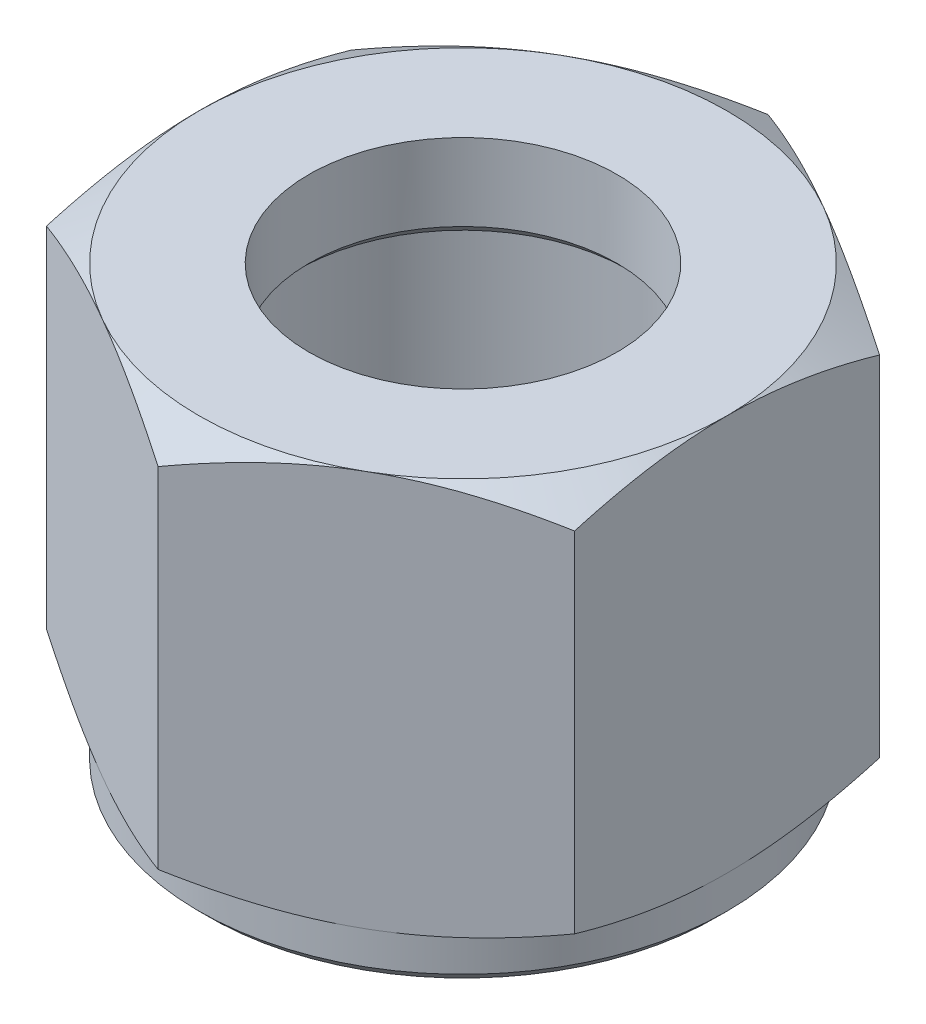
ISO-10303-21;
HEADER;
FILE_DESCRIPTION(('STEP AP214'),'2;1');
FILE_NAME('part.step','',(''),(''),'','','');
FILE_SCHEMA(('AUTOMOTIVE_DESIGN { 1 0 10303 214 1 1 1 1 }'));
ENDSEC;
DATA;
#1=APPLICATION_CONTEXT('core data for automotive mechanical design processes');
#2=APPLICATION_PROTOCOL_DEFINITION('international standard','automotive_design',2000,#1);
#3=PRODUCT_CONTEXT('',#1,'mechanical');
#4=PRODUCT('Part','Part','',(#3));
#5=PRODUCT_RELATED_PRODUCT_CATEGORY('part','',(#4));
#6=PRODUCT_DEFINITION_FORMATION('','',#4);
#7=PRODUCT_DEFINITION_CONTEXT('part definition',#1,'design');
#8=PRODUCT_DEFINITION('design','',#6,#7);
#9=PRODUCT_DEFINITION_SHAPE('','',#8);
#10=(LENGTH_UNIT() NAMED_UNIT(*) SI_UNIT(.MILLI.,.METRE.));
#11=(NAMED_UNIT(*) PLANE_ANGLE_UNIT() SI_UNIT($,.RADIAN.));
#12=(NAMED_UNIT(*) SI_UNIT($,.STERADIAN.) SOLID_ANGLE_UNIT());
#13=UNCERTAINTY_MEASURE_WITH_UNIT(LENGTH_MEASURE(1.E-05),#10,'distance_accuracy_value','');
#14=(GEOMETRIC_REPRESENTATION_CONTEXT(3) GLOBAL_UNCERTAINTY_ASSIGNED_CONTEXT((#13)) GLOBAL_UNIT_ASSIGNED_CONTEXT((#10,
#11,#12)) REPRESENTATION_CONTEXT('',''));
#15=CARTESIAN_POINT('',(0.,0.,0.));
#16=DIRECTION('',(0.,0.,1.));
#17=DIRECTION('',(1.,0.,0.));
#18=AXIS2_PLACEMENT_3D('',#15,#16,#17);
#19=CARTESIAN_POINT('',(12.,18.,-6.92820323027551));
#20=DIRECTION('',(-0.5,0.,0.866025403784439));
#21=DIRECTION('',(0.866025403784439,0.,0.5));
#22=AXIS2_PLACEMENT_3D('',#19,#20,#21);
#23=PLANE('',#22);
#24=CARTESIAN_POINT('',(-0.000199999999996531,1.07186343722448,-13.8565219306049));
#25=CARTESIAN_POINT('',(0.263585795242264,0.983949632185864,-13.7042251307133));
#26=CARTESIAN_POINT('',(0.528355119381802,0.90002599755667,-13.5513604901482));
#27=CARTESIAN_POINT('',(1.06001701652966,0.741266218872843,-13.244405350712));
#28=CARTESIAN_POINT('',(1.32691025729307,0.666433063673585,-13.0903144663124));
#29=CARTESIAN_POINT('',(2.13189040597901,0.457017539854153,-12.6255589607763));
#30=CARTESIAN_POINT('',(2.67315507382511,0.337903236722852,-12.3130596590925));
#31=CARTESIAN_POINT('',(3.483132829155,0.198231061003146,-11.8454187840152));
#32=CARTESIAN_POINT('',(3.74942610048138,0.158443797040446,-11.6916742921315));
#33=CARTESIAN_POINT('',(4.28324559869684,0.0917233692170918,-11.3834734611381));
#34=CARTESIAN_POINT('',(4.55077184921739,0.0647904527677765,-11.2290171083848));
#35=CARTESIAN_POINT('',(5.08627036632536,0.0244685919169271,-10.9198468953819));
#36=CARTESIAN_POINT('',(5.35424172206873,0.0110635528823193,-10.7651335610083));
#37=CARTESIAN_POINT('',(5.89043273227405,-0.00191690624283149,-10.4555635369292));
#38=CARTESIAN_POINT('',(6.15865237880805,-0.00149275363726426,-10.3007068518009));
#39=CARTESIAN_POINT('',(6.66008937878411,0.0122200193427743,-10.0112020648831));
#40=CARTESIAN_POINT('',(6.89334249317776,0.0238359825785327,-9.87653331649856));
#41=CARTESIAN_POINT('',(7.35931224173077,0.0573080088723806,-9.60750555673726));
#42=CARTESIAN_POINT('',(7.59202883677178,0.079164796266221,-9.47314656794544));
#43=CARTESIAN_POINT('',(8.05679907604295,0.132737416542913,-9.2048113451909));
#44=CARTESIAN_POINT('',(8.28885201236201,0.164461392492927,-9.07083551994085));
#45=CARTESIAN_POINT('',(8.75186996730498,0.237211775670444,-8.80351197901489));
#46=CARTESIAN_POINT('',(8.98283491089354,0.278238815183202,-8.67016430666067));
#47=CARTESIAN_POINT('',(9.68394195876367,0.416311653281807,-8.26537996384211));
#48=CARTESIAN_POINT('',(10.1520537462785,0.52712488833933,-7.99511549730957));
#49=CARTESIAN_POINT('',(11.0812971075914,0.778625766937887,-7.45861659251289));
#50=CARTESIAN_POINT('',(11.5424405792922,0.919254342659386,-7.19237528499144));
#51=CARTESIAN_POINT('',(12.0002,1.07186343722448,-6.92808776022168));
#52=B_SPLINE_CURVE_WITH_KNOTS('',3,(#24,#25,#26,#27,#28,#29,#30,#31,#32,#33,#34,#35,#36,#37,#38,
#39,#40,#41,#42,#43,#44,#45,#46,#47,#48,#49,#50,#51),.UNSPECIFIED.,.F.,.F.,(4,2,2,2,2,2,2,2,2,2,
2,2,2,4),(0.,0.951004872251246,1.90232158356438,3.80900466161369,4.73894551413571,
5.6689042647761,6.59775529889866,7.52657763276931,8.33514643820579,9.1437724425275,
9.95306755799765,10.7624176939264,12.4167102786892,14.0677556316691),.UNSPECIFIED.);
#53=CARTESIAN_POINT('',(0.,1.07179676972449,-13.856406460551));
#54=VERTEX_POINT('',#53);
#55=CARTESIAN_POINT('',(6.,0.,-10.3923048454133));
#56=VERTEX_POINT('',#55);
#57=EDGE_CURVE('E143',#54,#56,#52,.T.);
#58=ORIENTED_EDGE('',*,*,#57,.F.);
#59=DIRECTION('',(0.,-1.,0.));
#60=VECTOR('',#59,1.);
#61=CARTESIAN_POINT('',(0.,18.,-13.856406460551));
#62=LINE('',#61,#60);
#63=CARTESIAN_POINT('',(0.,16.9282032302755,-13.856406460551));
#64=VERTEX_POINT('',#63);
#65=EDGE_CURVE('E299',#64,#54,#62,.T.);
#66=ORIENTED_EDGE('',*,*,#65,.F.);
#67=CARTESIAN_POINT('',(12.0002,16.9281365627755,-6.92808776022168));
#68=CARTESIAN_POINT('',(11.7364142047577,17.0160503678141,-7.0803845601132));
#69=CARTESIAN_POINT('',(11.4716448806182,17.0999740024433,-7.23324920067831));
#70=CARTESIAN_POINT('',(10.9399829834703,17.2587337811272,-7.5402043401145));
#71=CARTESIAN_POINT('',(10.6730897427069,17.3335669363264,-7.69429522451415));
#72=CARTESIAN_POINT('',(9.86810959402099,17.5429824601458,-8.15905073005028));
#73=CARTESIAN_POINT('',(9.3268449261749,17.6620967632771,-8.47155003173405));
#74=CARTESIAN_POINT('',(8.51686717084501,17.8017689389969,-8.93919090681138));
#75=CARTESIAN_POINT('',(8.25057389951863,17.8415562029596,-9.09293539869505));
#76=CARTESIAN_POINT('',(7.71675440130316,17.9082766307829,-9.40113622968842));
#77=CARTESIAN_POINT('',(7.44922815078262,17.9352095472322,-9.55559258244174));
#78=CARTESIAN_POINT('',(6.91372963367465,17.9755314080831,-9.86476279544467));
#79=CARTESIAN_POINT('',(6.64575827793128,17.9889364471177,-10.0194761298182));
#80=CARTESIAN_POINT('',(6.10956726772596,18.0019169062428,-10.3290461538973));
#81=CARTESIAN_POINT('',(5.84134762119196,18.0014927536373,-10.4839028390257));
#82=CARTESIAN_POINT('',(5.3399106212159,17.9877799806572,-10.7734076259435));
#83=CARTESIAN_POINT('',(5.10665750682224,17.9761640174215,-10.908076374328));
#84=CARTESIAN_POINT('',(4.64068775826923,17.9426919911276,-11.1771041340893));
#85=CARTESIAN_POINT('',(4.40797116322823,17.9208352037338,-11.3114631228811));
#86=CARTESIAN_POINT('',(3.94320092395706,17.8672625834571,-11.5797983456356));
#87=CARTESIAN_POINT('',(3.711147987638,17.8355386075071,-11.7137741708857));
#88=CARTESIAN_POINT('',(3.24813003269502,17.7627882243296,-11.9810977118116));
#89=CARTESIAN_POINT('',(3.01716508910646,17.7217611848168,-12.1144453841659));
#90=CARTESIAN_POINT('',(2.31605804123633,17.5836883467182,-12.5192297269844));
#91=CARTESIAN_POINT('',(1.84794625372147,17.4728751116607,-12.789494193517));
#92=CARTESIAN_POINT('',(0.918702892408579,17.2213742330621,-13.3259930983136));
#93=CARTESIAN_POINT('',(0.457559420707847,17.0807456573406,-13.5922344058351));
#94=CARTESIAN_POINT('',(-0.000199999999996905,16.9281365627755,-13.8565219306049));
#95=B_SPLINE_CURVE_WITH_KNOTS('',3,(#67,#68,#69,#70,#71,#72,#73,#74,#75,#76,#77,#78,#79,#80,#81,
#82,#83,#84,#85,#86,#87,#88,#89,#90,#91,#92,#93,#94),.UNSPECIFIED.,.F.,.F.,(4,2,2,2,2,2,2,2,2,2,
2,2,2,4),(0.,0.951004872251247,1.90232158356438,3.80900466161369,4.7389455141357,
5.66890426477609,6.59775529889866,7.5265776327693,8.33514643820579,9.1437724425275,
9.95306755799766,10.7624176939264,12.4167102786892,14.0677556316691),.UNSPECIFIED.);
#96=CARTESIAN_POINT('',(6.,18.,-10.3923048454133));
#97=VERTEX_POINT('',#96);
#98=EDGE_CURVE('E574',#97,#64,#95,.T.);
#99=ORIENTED_EDGE('',*,*,#98,.F.);
#100=CARTESIAN_POINT('',(12.,16.9282032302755,-6.92820323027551));
#101=VERTEX_POINT('',#100);
#102=EDGE_CURVE('E571',#101,#97,#95,.T.);
#103=ORIENTED_EDGE('',*,*,#102,.F.);
#104=DIRECTION('',(0.,-1.,0.));
#105=VECTOR('',#104,1.);
#106=CARTESIAN_POINT('',(12.,18.,-6.92820323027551));
#107=LINE('',#106,#105);
#108=CARTESIAN_POINT('',(12.,1.07179676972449,-6.92820323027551));
#109=VERTEX_POINT('',#108);
#110=EDGE_CURVE('E165',#101,#109,#107,.T.);
#111=ORIENTED_EDGE('',*,*,#110,.T.);
#112=EDGE_CURVE('E151',#56,#109,#52,.T.);
#113=ORIENTED_EDGE('',*,*,#112,.F.);
#114=EDGE_LOOP('',(#58,#66,#99,#103,#111,#113));
#115=FACE_BOUND('',#114,.T.);
#116=ADVANCED_FACE('F41',(#115),#23,.F.);
#117=CARTESIAN_POINT('',(0.,18.,-13.856406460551));
#118=DIRECTION('',(0.5,0.,0.866025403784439));
#119=DIRECTION('',(0.866025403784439,0.,-0.5));
#120=AXIS2_PLACEMENT_3D('',#117,#118,#119);
#121=PLANE('',#120);
#122=CARTESIAN_POINT('',(-12.0002,1.07186343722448,-6.92808776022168));
#123=CARTESIAN_POINT('',(-11.7364142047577,0.983949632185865,-7.0803845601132));
#124=CARTESIAN_POINT('',(-11.4716448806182,0.900025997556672,-7.23324920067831));
#125=CARTESIAN_POINT('',(-10.9399829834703,0.741266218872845,-7.5402043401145));
#126=CARTESIAN_POINT('',(-10.6730897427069,0.666433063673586,-7.69429522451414));
#127=CARTESIAN_POINT('',(-9.868109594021,0.457017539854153,-8.15905073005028));
#128=CARTESIAN_POINT('',(-9.3268449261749,0.337903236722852,-8.47155003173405));
#129=CARTESIAN_POINT('',(-8.51686717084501,0.198231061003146,-8.93919090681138));
#130=CARTESIAN_POINT('',(-8.25057389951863,0.158443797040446,-9.09293539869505));
#131=CARTESIAN_POINT('',(-7.71675440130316,0.0917233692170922,-9.40113622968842));
#132=CARTESIAN_POINT('',(-7.44922815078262,0.0647904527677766,-9.55559258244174));
#133=CARTESIAN_POINT('',(-6.91372963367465,0.024468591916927,-9.86476279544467));
#134=CARTESIAN_POINT('',(-6.64575827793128,0.0110635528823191,-10.0194761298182));
#135=CARTESIAN_POINT('',(-6.10956726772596,-0.00191690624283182,-10.3290461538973));
#136=CARTESIAN_POINT('',(-5.84134762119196,-0.00149275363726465,-10.4839028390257));
#137=CARTESIAN_POINT('',(-5.3399106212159,0.0122200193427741,-10.7734076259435));
#138=CARTESIAN_POINT('',(-5.10665750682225,0.0238359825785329,-10.908076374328));
#139=CARTESIAN_POINT('',(-4.64068775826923,0.0573080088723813,-11.1771041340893));
#140=CARTESIAN_POINT('',(-4.40797116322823,0.0791647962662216,-11.3114631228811));
#141=CARTESIAN_POINT('',(-3.94320092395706,0.132737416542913,-11.5797983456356));
#142=CARTESIAN_POINT('',(-3.711147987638,0.164461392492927,-11.7137741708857));
#143=CARTESIAN_POINT('',(-3.24813003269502,0.237211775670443,-11.9810977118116));
#144=CARTESIAN_POINT('',(-3.01716508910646,0.278238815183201,-12.1144453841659));
#145=CARTESIAN_POINT('',(-2.31605804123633,0.416311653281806,-12.5192297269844));
#146=CARTESIAN_POINT('',(-1.84794625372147,0.52712488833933,-12.789494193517));
#147=CARTESIAN_POINT('',(-0.918702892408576,0.778625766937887,-13.3259930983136));
#148=CARTESIAN_POINT('',(-0.457559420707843,0.919254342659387,-13.5922344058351));
#149=CARTESIAN_POINT('',(0.000200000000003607,1.07186343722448,-13.8565219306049));
#150=B_SPLINE_CURVE_WITH_KNOTS('',3,(#122,#123,#124,#125,#126,#127,#128,#129,#130,#131,#132,
#133,#134,#135,#136,#137,#138,#139,#140,#141,#142,#143,#144,#145,#146,#147,#148,#149),
.UNSPECIFIED.,.F.,.F.,(4,2,2,2,2,2,2,2,2,2,2,2,2,4),(0.,0.951004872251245,1.90232158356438,
3.80900466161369,4.73894551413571,5.6689042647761,6.59775529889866,7.52657763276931,
8.3351464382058,9.1437724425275,9.95306755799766,10.7624176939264,12.4167102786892,
14.0677556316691),.UNSPECIFIED.);
#151=CARTESIAN_POINT('',(-12.,1.07179676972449,-6.92820323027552));
#152=VERTEX_POINT('',#151);
#153=CARTESIAN_POINT('',(-6.,0.,-10.3923048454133));
#154=VERTEX_POINT('',#153);
#155=EDGE_CURVE('E275',#152,#154,#150,.T.);
#156=ORIENTED_EDGE('',*,*,#155,.F.);
#157=DIRECTION('',(0.,-1.,0.));
#158=VECTOR('',#157,1.);
#159=CARTESIAN_POINT('',(-12.,18.,-6.92820323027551));
#160=LINE('',#159,#158);
#161=CARTESIAN_POINT('',(-12.,16.9282032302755,-6.92820323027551));
#162=VERTEX_POINT('',#161);
#163=EDGE_CURVE('E295',#162,#152,#160,.T.);
#164=ORIENTED_EDGE('',*,*,#163,.F.);
#165=CARTESIAN_POINT('',(0.000200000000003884,16.9281365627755,-13.8565219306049));
#166=CARTESIAN_POINT('',(-0.263585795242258,17.0160503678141,-13.7042251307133));
#167=CARTESIAN_POINT('',(-0.528355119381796,17.0999740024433,-13.5513604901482));
#168=CARTESIAN_POINT('',(-1.06001701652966,17.2587337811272,-13.244405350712));
#169=CARTESIAN_POINT('',(-1.32691025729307,17.3335669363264,-13.0903144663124));
#170=CARTESIAN_POINT('',(-2.13189040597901,17.5429824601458,-12.6255589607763));
#171=CARTESIAN_POINT('',(-2.6731550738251,17.6620967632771,-12.3130596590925));
#172=CARTESIAN_POINT('',(-3.483132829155,17.8017689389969,-11.8454187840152));
#173=CARTESIAN_POINT('',(-3.74942610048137,17.8415562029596,-11.6916742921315));
#174=CARTESIAN_POINT('',(-4.28324559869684,17.9082766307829,-11.3834734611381));
#175=CARTESIAN_POINT('',(-4.55077184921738,17.9352095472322,-11.2290171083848));
#176=CARTESIAN_POINT('',(-5.08627036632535,17.9755314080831,-10.9198468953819));
#177=CARTESIAN_POINT('',(-5.35424172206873,17.9889364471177,-10.7651335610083));
#178=CARTESIAN_POINT('',(-5.89043273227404,18.0019169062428,-10.4555635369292));
#179=CARTESIAN_POINT('',(-6.15865237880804,18.0014927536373,-10.3007068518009));
#180=CARTESIAN_POINT('',(-6.66008937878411,17.9877799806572,-10.0112020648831));
#181=CARTESIAN_POINT('',(-6.89334249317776,17.9761640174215,-9.87653331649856));
#182=CARTESIAN_POINT('',(-7.35931224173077,17.9426919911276,-9.60750555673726));
#183=CARTESIAN_POINT('',(-7.59202883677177,17.9208352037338,-9.47314656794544));
#184=CARTESIAN_POINT('',(-8.05679907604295,17.8672625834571,-9.2048113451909));
#185=CARTESIAN_POINT('',(-8.28885201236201,17.8355386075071,-9.07083551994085));
#186=CARTESIAN_POINT('',(-8.75186996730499,17.7627882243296,-8.80351197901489));
#187=CARTESIAN_POINT('',(-8.98283491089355,17.7217611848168,-8.67016430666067));
#188=CARTESIAN_POINT('',(-9.68394195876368,17.5836883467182,-8.26537996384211));
#189=CARTESIAN_POINT('',(-10.1520537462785,17.4728751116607,-7.99511549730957));
#190=CARTESIAN_POINT('',(-11.0812971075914,17.2213742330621,-7.45861659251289));
#191=CARTESIAN_POINT('',(-11.5424405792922,17.0807456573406,-7.19237528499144));
#192=CARTESIAN_POINT('',(-12.0002,16.9281365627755,-6.92808776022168));
#193=B_SPLINE_CURVE_WITH_KNOTS('',3,(#165,#166,#167,#168,#169,#170,#171,#172,#173,#174,#175,
#176,#177,#178,#179,#180,#181,#182,#183,#184,#185,#186,#187,#188,#189,#190,#191,#192),
.UNSPECIFIED.,.F.,.F.,(4,2,2,2,2,2,2,2,2,2,2,2,2,4),(0.,0.951004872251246,1.90232158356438,
3.80900466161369,4.73894551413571,5.6689042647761,6.59775529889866,7.52657763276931,
8.33514643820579,9.1437724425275,9.95306755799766,10.7624176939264,12.4167102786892,
14.0677556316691),.UNSPECIFIED.);
#194=CARTESIAN_POINT('',(-6.,18.,-10.3923048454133));
#195=VERTEX_POINT('',#194);
#196=EDGE_CURVE('E267',#195,#162,#193,.T.);
#197=ORIENTED_EDGE('',*,*,#196,.F.);
#198=EDGE_CURVE('E576',#64,#195,#193,.T.);
#199=ORIENTED_EDGE('',*,*,#198,.F.);
#200=ORIENTED_EDGE('',*,*,#65,.T.);
#201=EDGE_CURVE('E145',#154,#54,#150,.T.);
#202=ORIENTED_EDGE('',*,*,#201,.F.);
#203=EDGE_LOOP('',(#156,#164,#197,#199,#200,#202));
#204=FACE_BOUND('',#203,.T.);
#205=ADVANCED_FACE('F260',(#204),#121,.F.);
#206=CARTESIAN_POINT('',(-12.,18.,-6.92820323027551));
#207=DIRECTION('',(1.,0.,0.));
#208=DIRECTION('',(0.,0.,-1.));
#209=AXIS2_PLACEMENT_3D('',#206,#207,#208);
#210=PLANE('',#209);
#211=CARTESIAN_POINT('',(-12.,5.93015605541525,-18.761988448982));
#212=CARTESIAN_POINT('',(-12.,5.8023370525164,-18.4991845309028));
#213=CARTESIAN_POINT('',(-12.,5.67514427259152,-18.2360761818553));
#214=CARTESIAN_POINT('',(-12.,5.42215275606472,-17.7091871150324));
#215=CARTESIAN_POINT('',(-12.,5.2963540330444,-17.4454063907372));
#216=CARTESIAN_POINT('',(-12.,4.92122909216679,-16.6528920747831));
#217=CARTESIAN_POINT('',(-12.,4.67421096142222,-16.123061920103));
#218=CARTESIAN_POINT('',(-12.,4.18649967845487,-15.0570957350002));
#219=CARTESIAN_POINT('',(-12.,3.94584694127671,-14.5209411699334));
#220=CARTESIAN_POINT('',(-12.,3.47419167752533,-13.4444185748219));
#221=CARTESIAN_POINT('',(-12.,3.24318870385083,-12.9040507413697));
#222=CARTESIAN_POINT('',(-12.,2.78610353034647,-11.8006693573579));
#223=CARTESIAN_POINT('',(-12.,2.56042239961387,-11.2374888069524));
#224=CARTESIAN_POINT('',(-12.,2.12577473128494,-10.1045927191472));
#225=CARTESIAN_POINT('',(-12.,1.91681004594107,-9.534876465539));
#226=CARTESIAN_POINT('',(-12.,1.52096994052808,-8.38903647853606));
#227=CARTESIAN_POINT('',(-12.,1.33405120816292,-7.8129278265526));
#228=CARTESIAN_POINT('',(-12.,0.988186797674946,-6.65239659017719));
#229=CARTESIAN_POINT('',(-12.,0.829232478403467,-6.06797663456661));
#230=CARTESIAN_POINT('',(-12.,0.617856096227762,-5.18651066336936));
#231=CARTESIAN_POINT('',(-12.,0.552043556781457,-4.89265724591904));
#232=CARTESIAN_POINT('',(-12.,0.430221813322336,-4.30291479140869));
#233=CARTESIAN_POINT('',(-12.,0.374212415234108,-4.00702579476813));
#234=CARTESIAN_POINT('',(-12.,0.272976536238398,-3.41340813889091));
#235=CARTESIAN_POINT('',(-12.,0.227749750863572,-3.11567953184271));
#236=CARTESIAN_POINT('',(-12.,0.148974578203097,-2.51868256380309));
#237=CARTESIAN_POINT('',(-12.,0.115425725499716,-2.21941426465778));
#238=CARTESIAN_POINT('',(-12.,0.061102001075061,-1.62372788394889));
#239=CARTESIAN_POINT('',(-12.,0.0401631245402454,-1.32732485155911));
#240=CARTESIAN_POINT('',(-12.,0.0108462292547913,-0.733899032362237));
#241=CARTESIAN_POINT('',(-12.,0.00246799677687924,-0.436876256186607));
#242=CARTESIAN_POINT('',(-12.,-0.00152763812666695,0.157264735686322));
#243=CARTESIAN_POINT('',(-12.,0.00285526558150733,0.454382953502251));
#244=CARTESIAN_POINT('',(-12.,0.0242735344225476,1.04816621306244));
#245=CARTESIAN_POINT('',(-12.,0.0413094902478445,1.34483123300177));
#246=CARTESIAN_POINT('',(-12.,0.0967062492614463,2.05290252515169));
#247=CARTESIAN_POINT('',(-12.,0.140797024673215,2.46387036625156));
#248=CARTESIAN_POINT('',(-12.,0.250891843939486,3.28283839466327));
#249=CARTESIAN_POINT('',(-12.,0.316898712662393,3.69083819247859));
#250=CARTESIAN_POINT('',(-12.,0.544298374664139,4.90983684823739));
#251=CARTESIAN_POINT('',(-12.,0.735035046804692,5.71543863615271));
#252=CARTESIAN_POINT('',(-12.,1.06700971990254,6.92092838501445));
#253=CARTESIAN_POINT('',(-12.,1.18700530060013,7.32702513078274));
#254=CARTESIAN_POINT('',(-12.,1.43973785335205,8.13527300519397));
#255=CARTESIAN_POINT('',(-12.,1.57247493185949,8.53742410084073));
#256=CARTESIAN_POINT('',(-12.,1.8485399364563,9.33791822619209));
#257=CARTESIAN_POINT('',(-12.,1.9918649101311,9.73626228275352));
#258=CARTESIAN_POINT('',(-12.,2.21350430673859,10.3312808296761));
#259=CARTESIAN_POINT('',(-12.,2.28849198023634,10.5292021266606));
#260=CARTESIAN_POINT('',(-12.,2.44050041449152,10.9242626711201));
#261=CARTESIAN_POINT('',(-12.,2.5175211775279,11.1214019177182));
#262=CARTESIAN_POINT('',(-12.,2.75201451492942,11.7133501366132));
#263=CARTESIAN_POINT('',(-12.,2.91230253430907,12.1070454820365));
#264=CARTESIAN_POINT('',(-12.,3.23915362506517,12.8918284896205));
#265=CARTESIAN_POINT('',(-12.,3.40571691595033,13.2829160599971));
#266=CARTESIAN_POINT('',(-12.,3.74414891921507,14.0628409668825));
#267=CARTESIAN_POINT('',(-12.,3.916018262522,14.4516780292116));
#268=CARTESIAN_POINT('',(-12.,4.26424280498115,15.2273406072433));
#269=CARTESIAN_POINT('',(-12.,4.44059806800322,15.614166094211));
#270=CARTESIAN_POINT('',(-12.,4.97554471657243,16.7723918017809));
#271=CARTESIAN_POINT('',(-12.,5.33984760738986,17.541154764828));
#272=CARTESIAN_POINT('',(-12.,6.07962873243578,19.0731969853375));
#273=CARTESIAN_POINT('',(-12.,6.45510628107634,19.8364765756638));
#274=CARTESIAN_POINT('',(-12.,7.21528477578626,21.3602920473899));
#275=CARTESIAN_POINT('',(-12.,7.60000237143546,22.1208196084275));
#276=CARTESIAN_POINT('',(-12.,8.37599901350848,23.6385255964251));
#277=CARTESIAN_POINT('',(-12.,8.76727814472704,24.3957039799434));
#278=CARTESIAN_POINT('',(-12.,9.55486583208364,25.9071520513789));
#279=CARTESIAN_POINT('',(-12.,9.95117286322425,26.6614225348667));
#280=CARTESIAN_POINT('',(-12.,10.7478929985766,28.1677850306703));
#281=CARTESIAN_POINT('',(-12.,11.1483060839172,28.9198770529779));
#282=CARTESIAN_POINT('',(-12.,12.2541451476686,30.9859910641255));
#283=CARTESIAN_POINT('',(-12.,12.9629824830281,32.2981866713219));
#284=CARTESIAN_POINT('',(-12.,14.3878944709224,34.9187800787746));
#285=CARTESIAN_POINT('',(-12.,15.1039697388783,36.2271775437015));
#286=CARTESIAN_POINT('',(-12.,16.5386827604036,38.8360831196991));
#287=CARTESIAN_POINT('',(-12.,17.2573003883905,40.1366023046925));
#288=CARTESIAN_POINT('',(-12.,18.3381788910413,42.0856582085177));
#289=CARTESIAN_POINT('',(-12.,18.6989458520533,42.7350243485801));
#290=CARTESIAN_POINT('',(-12.,19.4213608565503,44.0332655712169));
#291=CARTESIAN_POINT('',(-12.,19.7830088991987,44.6821406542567));
#292=CARTESIAN_POINT('',(-12.,20.1450405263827,45.3308016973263));
#293=B_SPLINE_CURVE_WITH_KNOTS('',3,(#211,#212,#213,#214,#215,#216,#217,#218,#219,#220,#221,
#222,#223,#224,#225,#226,#227,#228,#229,#230,#231,#232,#233,#234,#235,#236,#237,#238,#239,#240,
#241,#242,#243,#244,#245,#246,#247,#248,#249,#250,#251,#252,#253,#254,#255,#256,#257,#258,#259,
#260,#261,#262,#263,#264,#265,#266,#267,#268,#269,#270,#271,#272,#273,#274,#275,#276,#277,#278,
#279,#280,#281,#282,#283,#284,#285,#286,#287,#288,#289,#290,#291,#292),.UNSPECIFIED.,.F.,.F.,(4,
2,2,2,2,2,2,2,2,2,2,2,2,2,2,2,2,2,2,2,2,2,2,2,2,2,2,2,2,2,2,2,2,2,2,2,2,2,2,2,4),(0.,
0.876715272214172,1.75343907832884,3.50713894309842,5.27012437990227,7.03302804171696,
8.85297337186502,10.6731200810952,12.489629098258,14.3055758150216,15.2088379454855,
16.1120821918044,17.0153009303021,17.9184836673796,18.8096506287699,19.7008024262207,
20.5919756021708,21.4831903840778,22.7224730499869,23.9619155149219,26.4419887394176,
27.7122404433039,28.9825027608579,30.2524121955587,30.8873542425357,31.5222970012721,
32.7974483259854,34.0726442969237,35.347992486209,36.6233588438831,39.1753572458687,
41.7271993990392,44.2840478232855,46.8409293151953,49.3970529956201,51.9531649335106,
56.4273629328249,60.9019446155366,65.3594960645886,67.5880517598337,69.8166053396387),.UNSPECIFIED.);
#294=CARTESIAN_POINT('',(-12.,1.07179676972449,6.92820323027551));
#295=VERTEX_POINT('',#294);
#296=CARTESIAN_POINT('',(-12.,0.,0.));
#297=VERTEX_POINT('',#296);
#298=EDGE_CURVE('E285',#295,#297,#293,.F.);
#299=ORIENTED_EDGE('',*,*,#298,.F.);
#300=DIRECTION('',(0.,-1.,0.));
#301=VECTOR('',#300,1.);
#302=CARTESIAN_POINT('',(-12.,18.,6.92820323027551));
#303=LINE('',#302,#301);
#304=CARTESIAN_POINT('',(-12.,16.9282032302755,6.92820323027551));
#305=VERTEX_POINT('',#304);
#306=EDGE_CURVE('E300',#305,#295,#303,.T.);
#307=ORIENTED_EDGE('',*,*,#306,.F.);
#308=CARTESIAN_POINT('',(-12.,12.0698439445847,-18.761988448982));
#309=CARTESIAN_POINT('',(-12.,12.1976629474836,-18.4991845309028));
#310=CARTESIAN_POINT('',(-12.,12.3248557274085,-18.2360761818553));
#311=CARTESIAN_POINT('',(-12.,12.5778472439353,-17.7091871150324));
#312=CARTESIAN_POINT('',(-12.,12.7036459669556,-17.4454063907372));
#313=CARTESIAN_POINT('',(-12.,13.0787709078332,-16.6528920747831));
#314=CARTESIAN_POINT('',(-12.,13.3257890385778,-16.123061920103));
#315=CARTESIAN_POINT('',(-12.,13.8135003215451,-15.0570957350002));
#316=CARTESIAN_POINT('',(-12.,14.0541530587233,-14.5209411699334));
#317=CARTESIAN_POINT('',(-12.,14.5258083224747,-13.4444185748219));
#318=CARTESIAN_POINT('',(-12.,14.7568112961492,-12.9040507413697));
#319=CARTESIAN_POINT('',(-12.,15.2138964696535,-11.8006693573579));
#320=CARTESIAN_POINT('',(-12.,15.4395776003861,-11.2374888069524));
#321=CARTESIAN_POINT('',(-12.,15.8742252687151,-10.1045927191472));
#322=CARTESIAN_POINT('',(-12.,16.0831899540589,-9.534876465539));
#323=CARTESIAN_POINT('',(-12.,16.4790300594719,-8.38903647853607));
#324=CARTESIAN_POINT('',(-12.,16.6659487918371,-7.81292782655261));
#325=CARTESIAN_POINT('',(-12.,17.0118132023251,-6.6523965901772));
#326=CARTESIAN_POINT('',(-12.,17.1707675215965,-6.06797663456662));
#327=CARTESIAN_POINT('',(-12.,17.3821439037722,-5.18651066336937));
#328=CARTESIAN_POINT('',(-12.,17.4479564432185,-4.89265724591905));
#329=CARTESIAN_POINT('',(-12.,17.5697781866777,-4.3029147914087));
#330=CARTESIAN_POINT('',(-12.,17.6257875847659,-4.00702579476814));
#331=CARTESIAN_POINT('',(-12.,17.7270234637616,-3.41340813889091));
#332=CARTESIAN_POINT('',(-12.,17.7722502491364,-3.11567953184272));
#333=CARTESIAN_POINT('',(-12.,17.8510254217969,-2.5186825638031));
#334=CARTESIAN_POINT('',(-12.,17.8845742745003,-2.21941426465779));
#335=CARTESIAN_POINT('',(-12.,17.9388979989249,-1.6237278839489));
#336=CARTESIAN_POINT('',(-12.,17.9598368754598,-1.32732485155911));
#337=CARTESIAN_POINT('',(-12.,17.9891537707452,-0.733899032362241));
#338=CARTESIAN_POINT('',(-12.,17.9975320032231,-0.436876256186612));
#339=CARTESIAN_POINT('',(-12.,18.0015276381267,0.157264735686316));
#340=CARTESIAN_POINT('',(-12.,17.9971447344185,0.454382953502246));
#341=CARTESIAN_POINT('',(-12.,17.9757264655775,1.04816621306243));
#342=CARTESIAN_POINT('',(-12.,17.9586905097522,1.34483123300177));
#343=CARTESIAN_POINT('',(-12.,17.9032937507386,2.05290252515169));
#344=CARTESIAN_POINT('',(-12.,17.8592029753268,2.46387036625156));
#345=CARTESIAN_POINT('',(-12.,17.7491081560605,3.28283839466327));
#346=CARTESIAN_POINT('',(-12.,17.6831012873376,3.69083819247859));
#347=CARTESIAN_POINT('',(-12.,17.4557016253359,4.90983684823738));
#348=CARTESIAN_POINT('',(-12.,17.2649649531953,5.71543863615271));
#349=CARTESIAN_POINT('',(-12.,16.9329902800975,6.92092838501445));
#350=CARTESIAN_POINT('',(-12.,16.8129946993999,7.32702513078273));
#351=CARTESIAN_POINT('',(-12.,16.560262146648,8.13527300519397));
#352=CARTESIAN_POINT('',(-12.,16.4275250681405,8.53742410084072));
#353=CARTESIAN_POINT('',(-12.,16.1514600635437,9.33791822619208));
#354=CARTESIAN_POINT('',(-12.,16.0081350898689,9.73626228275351));
#355=CARTESIAN_POINT('',(-12.,15.7864956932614,10.3312808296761));
#356=CARTESIAN_POINT('',(-12.,15.7115080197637,10.5292021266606));
#357=CARTESIAN_POINT('',(-12.,15.5594995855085,10.9242626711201));
#358=CARTESIAN_POINT('',(-12.,15.4824788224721,11.1214019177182));
#359=CARTESIAN_POINT('',(-12.,15.2479854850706,11.7133501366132));
#360=CARTESIAN_POINT('',(-12.,15.0876974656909,12.1070454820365));
#361=CARTESIAN_POINT('',(-12.,14.7608463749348,12.8918284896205));
#362=CARTESIAN_POINT('',(-12.,14.5942830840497,13.2829160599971));
#363=CARTESIAN_POINT('',(-12.,14.2558510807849,14.0628409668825));
#364=CARTESIAN_POINT('',(-12.,14.083981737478,14.4516780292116));
#365=CARTESIAN_POINT('',(-12.,13.7357571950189,15.2273406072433));
#366=CARTESIAN_POINT('',(-12.,13.5594019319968,15.6141660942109));
#367=CARTESIAN_POINT('',(-12.,13.0244552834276,16.7723918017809));
#368=CARTESIAN_POINT('',(-12.,12.6601523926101,17.541154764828));
#369=CARTESIAN_POINT('',(-12.,11.9203712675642,19.0731969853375));
#370=CARTESIAN_POINT('',(-12.,11.5448937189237,19.8364765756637));
#371=CARTESIAN_POINT('',(-12.,10.7847152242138,21.3602920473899));
#372=CARTESIAN_POINT('',(-12.,10.3999976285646,22.1208196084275));
#373=CARTESIAN_POINT('',(-12.,9.62400098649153,23.638525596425));
#374=CARTESIAN_POINT('',(-12.,9.23272185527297,24.3957039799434));
#375=CARTESIAN_POINT('',(-12.,8.44513416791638,25.9071520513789));
#376=CARTESIAN_POINT('',(-12.,8.04882713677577,26.6614225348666));
#377=CARTESIAN_POINT('',(-12.,7.25210700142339,28.1677850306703));
#378=CARTESIAN_POINT('',(-12.,6.85169391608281,28.9198770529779));
#379=CARTESIAN_POINT('',(-12.,5.74585485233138,30.9859910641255));
#380=CARTESIAN_POINT('',(-12.,5.03701751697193,32.2981866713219));
#381=CARTESIAN_POINT('',(-12.,3.61210552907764,34.9187800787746));
#382=CARTESIAN_POINT('',(-12.,2.89603026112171,36.2271775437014));
#383=CARTESIAN_POINT('',(-12.,1.46131723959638,38.8360831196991));
#384=CARTESIAN_POINT('',(-12.,0.74269961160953,40.1366023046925));
#385=CARTESIAN_POINT('',(-12.,-0.338178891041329,42.0856582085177));
#386=CARTESIAN_POINT('',(-12.,-0.69894585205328,42.7350243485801));
#387=CARTESIAN_POINT('',(-12.,-1.42136085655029,44.0332655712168));
#388=CARTESIAN_POINT('',(-12.,-1.78300889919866,44.6821406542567));
#389=CARTESIAN_POINT('',(-12.,-2.14504052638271,45.3308016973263));
#390=B_SPLINE_CURVE_WITH_KNOTS('',3,(#308,#309,#310,#311,#312,#313,#314,#315,#316,#317,#318,
#319,#320,#321,#322,#323,#324,#325,#326,#327,#328,#329,#330,#331,#332,#333,#334,#335,#336,#337,
#338,#339,#340,#341,#342,#343,#344,#345,#346,#347,#348,#349,#350,#351,#352,#353,#354,#355,#356,
#357,#358,#359,#360,#361,#362,#363,#364,#365,#366,#367,#368,#369,#370,#371,#372,#373,#374,#375,
#376,#377,#378,#379,#380,#381,#382,#383,#384,#385,#386,#387,#388,#389),.UNSPECIFIED.,.F.,.F.,(4,
2,2,2,2,2,2,2,2,2,2,2,2,2,2,2,2,2,2,2,2,2,2,2,2,2,2,2,2,2,2,2,2,2,2,2,2,2,2,2,4),(0.,
0.876715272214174,1.75343907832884,3.50713894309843,5.27012437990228,7.03302804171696,
8.85297337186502,10.6731200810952,12.489629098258,14.3055758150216,15.2088379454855,
16.1120821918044,17.0153009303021,17.9184836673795,18.8096506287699,19.7008024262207,
20.5919756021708,21.4831903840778,22.7224730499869,23.9619155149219,26.4419887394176,
27.7122404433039,28.9825027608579,30.2524121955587,30.8873542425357,31.5222970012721,
32.7974483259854,34.0726442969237,35.347992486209,36.6233588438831,39.1753572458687,
41.7271993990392,44.2840478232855,46.8409293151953,49.3970529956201,51.9531649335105,
56.4273629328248,60.9019446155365,65.3594960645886,67.5880517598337,69.8166053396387),.UNSPECIFIED.);
#391=CARTESIAN_POINT('',(-12.,18.,0.));
#392=VERTEX_POINT('',#391);
#393=EDGE_CURVE('E247',#392,#305,#390,.T.);
#394=ORIENTED_EDGE('',*,*,#393,.F.);
#395=EDGE_CURVE('E297',#162,#392,#390,.T.);
#396=ORIENTED_EDGE('',*,*,#395,.F.);
#397=ORIENTED_EDGE('',*,*,#163,.T.);
#398=EDGE_CURVE('E205',#297,#152,#293,.F.);
#399=ORIENTED_EDGE('',*,*,#398,.F.);
#400=EDGE_LOOP('',(#299,#307,#394,#396,#397,#399));
#401=FACE_BOUND('',#400,.T.);
#402=ADVANCED_FACE('F255',(#401),#210,.F.);
#403=CARTESIAN_POINT('',(-12.,18.,6.92820323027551));
#404=DIRECTION('',(0.5,0.,-0.866025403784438));
#405=DIRECTION('',(-0.866025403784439,0.,-0.5));
#406=AXIS2_PLACEMENT_3D('',#403,#404,#405);
#407=PLANE('',#406);
#408=CARTESIAN_POINT('',(0.000199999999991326,1.07186343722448,13.8565219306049));
#409=CARTESIAN_POINT('',(-0.263585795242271,0.983949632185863,13.7042251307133));
#410=CARTESIAN_POINT('',(-0.528355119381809,0.900025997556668,13.5513604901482));
#411=CARTESIAN_POINT('',(-1.06001701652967,0.741266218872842,13.244405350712));
#412=CARTESIAN_POINT('',(-1.32691025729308,0.666433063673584,13.0903144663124));
#413=CARTESIAN_POINT('',(-2.13189040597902,0.457017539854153,12.6255589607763));
#414=CARTESIAN_POINT('',(-2.67315507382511,0.337903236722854,12.3130596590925));
#415=CARTESIAN_POINT('',(-3.48313282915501,0.198231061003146,11.8454187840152));
#416=CARTESIAN_POINT('',(-3.74942610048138,0.158443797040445,11.6916742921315));
#417=CARTESIAN_POINT('',(-4.28324559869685,0.0917233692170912,11.3834734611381));
#418=CARTESIAN_POINT('',(-4.55077184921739,0.0647904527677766,11.2290171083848));
#419=CARTESIAN_POINT('',(-5.08627036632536,0.024468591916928,10.9198468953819));
#420=CARTESIAN_POINT('',(-5.35424172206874,0.0110635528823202,10.7651335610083));
#421=CARTESIAN_POINT('',(-5.89043273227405,-0.0019169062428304,10.4555635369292));
#422=CARTESIAN_POINT('',(-6.15865237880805,-0.00149275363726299,10.3007068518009));
#423=CARTESIAN_POINT('',(-6.66008937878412,0.0122200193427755,10.0112020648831));
#424=CARTESIAN_POINT('',(-6.89334249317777,0.0238359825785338,9.87653331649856));
#425=CARTESIAN_POINT('',(-7.35931224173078,0.0573080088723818,9.60750555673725));
#426=CARTESIAN_POINT('',(-7.59202883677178,0.0791647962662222,9.47314656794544));
#427=CARTESIAN_POINT('',(-8.05679907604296,0.132737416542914,9.2048113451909));
#428=CARTESIAN_POINT('',(-8.28885201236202,0.164461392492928,9.07083551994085));
#429=CARTESIAN_POINT('',(-8.75186996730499,0.237211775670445,8.80351197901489));
#430=CARTESIAN_POINT('',(-8.98283491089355,0.278238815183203,8.67016430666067));
#431=CARTESIAN_POINT('',(-9.68394195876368,0.416311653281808,8.2653799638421));
#432=CARTESIAN_POINT('',(-10.1520537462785,0.527124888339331,7.99511549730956));
#433=CARTESIAN_POINT('',(-11.0812971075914,0.77862576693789,7.45861659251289));
#434=CARTESIAN_POINT('',(-11.5424405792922,0.919254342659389,7.19237528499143));
#435=CARTESIAN_POINT('',(-12.0002,1.07186343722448,6.92808776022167));
#436=B_SPLINE_CURVE_WITH_KNOTS('',3,(#408,#409,#410,#411,#412,#413,#414,#415,#416,#417,#418,
#419,#420,#421,#422,#423,#424,#425,#426,#427,#428,#429,#430,#431,#432,#433,#434,#435),
.UNSPECIFIED.,.F.,.F.,(4,2,2,2,2,2,2,2,2,2,2,2,2,4),(0.,0.951004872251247,1.90232158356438,
3.80900466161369,4.7389455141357,5.6689042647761,6.59775529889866,7.52657763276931,
8.33514643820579,9.1437724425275,9.95306755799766,10.7624176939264,12.4167102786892,
14.0677556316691),.UNSPECIFIED.);
#437=CARTESIAN_POINT('',(0.,1.07179676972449,13.856406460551));
#438=VERTEX_POINT('',#437);
#439=CARTESIAN_POINT('',(-6.00000000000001,0.,10.3923048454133));
#440=VERTEX_POINT('',#439);
#441=EDGE_CURVE('E180',#438,#440,#436,.T.);
#442=ORIENTED_EDGE('',*,*,#441,.F.);
#443=DIRECTION('',(0.,-1.,0.));
#444=VECTOR('',#443,1.);
#445=CARTESIAN_POINT('',(0.,18.,13.856406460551));
#446=LINE('',#445,#444);
#447=CARTESIAN_POINT('',(0.,16.9282032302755,13.856406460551));
#448=VERTEX_POINT('',#447);
#449=EDGE_CURVE('E304',#448,#438,#446,.T.);
#450=ORIENTED_EDGE('',*,*,#449,.F.);
#451=CARTESIAN_POINT('',(-12.0002,16.9281365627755,6.92808776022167));
#452=CARTESIAN_POINT('',(-11.7364142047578,17.0160503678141,7.08038456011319));
#453=CARTESIAN_POINT('',(-11.4716448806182,17.0999740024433,7.23324920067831));
#454=CARTESIAN_POINT('',(-10.9399829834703,17.2587337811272,7.5402043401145));
#455=CARTESIAN_POINT('',(-10.6730897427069,17.3335669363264,7.69429522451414));
#456=CARTESIAN_POINT('',(-9.868109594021,17.5429824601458,8.15905073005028));
#457=CARTESIAN_POINT('',(-9.32684492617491,17.6620967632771,8.47155003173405));
#458=CARTESIAN_POINT('',(-8.51686717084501,17.8017689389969,8.93919090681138));
#459=CARTESIAN_POINT('',(-8.25057389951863,17.8415562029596,9.09293539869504));
#460=CARTESIAN_POINT('',(-7.71675440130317,17.9082766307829,9.40113622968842));
#461=CARTESIAN_POINT('',(-7.44922815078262,17.9352095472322,9.55559258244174));
#462=CARTESIAN_POINT('',(-6.91372963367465,17.9755314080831,9.86476279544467));
#463=CARTESIAN_POINT('',(-6.64575827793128,17.9889364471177,10.0194761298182));
#464=CARTESIAN_POINT('',(-6.10956726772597,18.0019169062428,10.3290461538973));
#465=CARTESIAN_POINT('',(-5.84134762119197,18.0014927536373,10.4839028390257));
#466=CARTESIAN_POINT('',(-5.3399106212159,17.9877799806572,10.7734076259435));
#467=CARTESIAN_POINT('',(-5.10665750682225,17.9761640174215,10.908076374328));
#468=CARTESIAN_POINT('',(-4.64068775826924,17.9426919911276,11.1771041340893));
#469=CARTESIAN_POINT('',(-4.40797116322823,17.9208352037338,11.3114631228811));
#470=CARTESIAN_POINT('',(-3.94320092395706,17.8672625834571,11.5797983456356));
#471=CARTESIAN_POINT('',(-3.711147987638,17.8355386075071,11.7137741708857));
#472=CARTESIAN_POINT('',(-3.24813003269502,17.7627882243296,11.9810977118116));
#473=CARTESIAN_POINT('',(-3.01716508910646,17.7217611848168,12.1144453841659));
#474=CARTESIAN_POINT('',(-2.31605804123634,17.5836883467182,12.5192297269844));
#475=CARTESIAN_POINT('',(-1.84794625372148,17.4728751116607,12.789494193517));
#476=CARTESIAN_POINT('',(-0.918702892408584,17.2213742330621,13.3259930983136));
#477=CARTESIAN_POINT('',(-0.457559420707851,17.0807456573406,13.5922344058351));
#478=CARTESIAN_POINT('',(0.000199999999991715,16.9281365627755,13.8565219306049));
#479=B_SPLINE_CURVE_WITH_KNOTS('',3,(#451,#452,#453,#454,#455,#456,#457,#458,#459,#460,#461,
#462,#463,#464,#465,#466,#467,#468,#469,#470,#471,#472,#473,#474,#475,#476,#477,#478),
.UNSPECIFIED.,.F.,.F.,(4,2,2,2,2,2,2,2,2,2,2,2,2,4),(0.,0.951004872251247,1.90232158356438,
3.80900466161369,4.73894551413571,5.6689042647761,6.59775529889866,7.52657763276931,
8.3351464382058,9.1437724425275,9.95306755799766,10.7624176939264,12.4167102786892,
14.0677556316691),.UNSPECIFIED.);
#480=CARTESIAN_POINT('',(-6.00000000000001,18.,10.3923048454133));
#481=VERTEX_POINT('',#480);
#482=EDGE_CURVE('E241',#481,#448,#479,.T.);
#483=ORIENTED_EDGE('',*,*,#482,.F.);
#484=EDGE_CURVE('E246',#305,#481,#479,.T.);
#485=ORIENTED_EDGE('',*,*,#484,.F.);
#486=ORIENTED_EDGE('',*,*,#306,.T.);
#487=EDGE_CURVE('E276',#440,#295,#436,.T.);
#488=ORIENTED_EDGE('',*,*,#487,.F.);
#489=EDGE_LOOP('',(#442,#450,#483,#485,#486,#488));
#490=FACE_BOUND('',#489,.T.);
#491=ADVANCED_FACE('F252',(#490),#407,.F.);
#492=CARTESIAN_POINT('',(0.,18.,13.856406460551));
#493=DIRECTION('',(-0.5,0.,-0.866025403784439));
#494=DIRECTION('',(-0.866025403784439,0.,0.5));
#495=AXIS2_PLACEMENT_3D('',#492,#493,#494);
#496=PLANE('',#495);
#497=CARTESIAN_POINT('',(12.0002,1.07186343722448,6.92808776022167));
#498=CARTESIAN_POINT('',(11.7364142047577,0.98394963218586,7.08038456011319));
#499=CARTESIAN_POINT('',(11.4716448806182,0.900025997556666,7.2332492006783));
#500=CARTESIAN_POINT('',(10.9399829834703,0.74126621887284,7.54020434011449));
#501=CARTESIAN_POINT('',(10.6730897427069,0.666433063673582,7.69429522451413));
#502=CARTESIAN_POINT('',(9.86810959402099,0.457017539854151,8.15905073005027));
#503=CARTESIAN_POINT('',(9.3268449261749,0.337903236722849,8.47155003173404));
#504=CARTESIAN_POINT('',(8.51686717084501,0.198231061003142,8.93919090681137));
#505=CARTESIAN_POINT('',(8.25057389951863,0.158443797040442,9.09293539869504));
#506=CARTESIAN_POINT('',(7.71675440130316,0.0917233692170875,9.40113622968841));
#507=CARTESIAN_POINT('',(7.44922815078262,0.064790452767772,9.55559258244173));
#508=CARTESIAN_POINT('',(6.91372963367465,0.0244685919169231,9.86476279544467));
#509=CARTESIAN_POINT('',(6.64575827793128,0.0110635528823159,10.0194761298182));
#510=CARTESIAN_POINT('',(6.10956726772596,-0.00191690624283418,10.3290461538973));
#511=CARTESIAN_POINT('',(5.84134762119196,-0.00149275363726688,10.4839028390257));
#512=CARTESIAN_POINT('',(5.3399106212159,0.0122200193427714,10.7734076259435));
#513=CARTESIAN_POINT('',(5.10665750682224,0.0238359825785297,10.908076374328));
#514=CARTESIAN_POINT('',(4.64068775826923,0.057308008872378,11.1771041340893));
#515=CARTESIAN_POINT('',(4.40797116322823,0.0791647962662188,11.3114631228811));
#516=CARTESIAN_POINT('',(3.94320092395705,0.13273741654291,11.5797983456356));
#517=CARTESIAN_POINT('',(3.71114798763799,0.164461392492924,11.7137741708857));
#518=CARTESIAN_POINT('',(3.24813003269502,0.237211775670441,11.9810977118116));
#519=CARTESIAN_POINT('',(3.01716508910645,0.278238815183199,12.1144453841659));
#520=CARTESIAN_POINT('',(2.31605804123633,0.416311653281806,12.5192297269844));
#521=CARTESIAN_POINT('',(1.84794625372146,0.527124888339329,12.789494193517));
#522=CARTESIAN_POINT('',(0.918702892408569,0.778625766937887,13.3259930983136));
#523=CARTESIAN_POINT('',(0.457559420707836,0.919254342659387,13.5922344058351));
#524=CARTESIAN_POINT('',(-0.000200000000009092,1.07186343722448,13.8565219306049));
#525=B_SPLINE_CURVE_WITH_KNOTS('',3,(#497,#498,#499,#500,#501,#502,#503,#504,#505,#506,#507,
#508,#509,#510,#511,#512,#513,#514,#515,#516,#517,#518,#519,#520,#521,#522,#523,#524),
.UNSPECIFIED.,.F.,.F.,(4,2,2,2,2,2,2,2,2,2,2,2,2,4),(0.,0.951004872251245,1.90232158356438,
3.80900466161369,4.73894551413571,5.6689042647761,6.59775529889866,7.52657763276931,
8.3351464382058,9.1437724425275,9.95306755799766,10.7624176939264,12.4167102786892,
14.0677556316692),.UNSPECIFIED.);
#526=CARTESIAN_POINT('',(12.,1.07179676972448,6.92820323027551));
#527=VERTEX_POINT('',#526);
#528=CARTESIAN_POINT('',(6.00000000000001,0.,10.3923048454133));
#529=VERTEX_POINT('',#528);
#530=EDGE_CURVE('E166',#527,#529,#525,.T.);
#531=ORIENTED_EDGE('',*,*,#530,.F.);
#532=DIRECTION('',(0.,-1.,0.));
#533=VECTOR('',#532,1.);
#534=CARTESIAN_POINT('',(12.,18.,6.92820323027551));
#535=LINE('',#534,#533);
#536=CARTESIAN_POINT('',(12.,16.9282032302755,6.92820323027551));
#537=VERTEX_POINT('',#536);
#538=EDGE_CURVE('E568',#537,#527,#535,.T.);
#539=ORIENTED_EDGE('',*,*,#538,.F.);
#540=CARTESIAN_POINT('',(-0.000200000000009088,16.9281365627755,13.8565219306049));
#541=CARTESIAN_POINT('',(0.263585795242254,17.0160503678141,13.7042251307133));
#542=CARTESIAN_POINT('',(0.528355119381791,17.0999740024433,13.5513604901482));
#543=CARTESIAN_POINT('',(1.06001701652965,17.2587337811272,13.244405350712));
#544=CARTESIAN_POINT('',(1.32691025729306,17.3335669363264,13.0903144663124));
#545=CARTESIAN_POINT('',(2.131890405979,17.5429824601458,12.6255589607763));
#546=CARTESIAN_POINT('',(2.6731550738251,17.6620967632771,12.3130596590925));
#547=CARTESIAN_POINT('',(3.48313282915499,17.8017689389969,11.8454187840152));
#548=CARTESIAN_POINT('',(3.74942610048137,17.8415562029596,11.6916742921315));
#549=CARTESIAN_POINT('',(4.28324559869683,17.9082766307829,11.3834734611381));
#550=CARTESIAN_POINT('',(4.55077184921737,17.9352095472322,11.2290171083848));
#551=CARTESIAN_POINT('',(5.08627036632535,17.9755314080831,10.9198468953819));
#552=CARTESIAN_POINT('',(5.35424172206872,17.9889364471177,10.7651335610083));
#553=CARTESIAN_POINT('',(5.89043273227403,18.0019169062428,10.4555635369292));
#554=CARTESIAN_POINT('',(6.15865237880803,18.0014927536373,10.3007068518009));
#555=CARTESIAN_POINT('',(6.6600893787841,17.9877799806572,10.0112020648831));
#556=CARTESIAN_POINT('',(6.89334249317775,17.9761640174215,9.87653331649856));
#557=CARTESIAN_POINT('',(7.35931224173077,17.9426919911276,9.60750555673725));
#558=CARTESIAN_POINT('',(7.59202883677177,17.9208352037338,9.47314656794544));
#559=CARTESIAN_POINT('',(8.05679907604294,17.8672625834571,9.2048113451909));
#560=CARTESIAN_POINT('',(8.288852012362,17.8355386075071,9.07083551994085));
#561=CARTESIAN_POINT('',(8.75186996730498,17.7627882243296,8.80351197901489));
#562=CARTESIAN_POINT('',(8.98283491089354,17.7217611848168,8.67016430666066));
#563=CARTESIAN_POINT('',(9.68394195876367,17.5836883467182,8.2653799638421));
#564=CARTESIAN_POINT('',(10.1520537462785,17.4728751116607,7.99511549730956));
#565=CARTESIAN_POINT('',(11.0812971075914,17.2213742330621,7.45861659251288));
#566=CARTESIAN_POINT('',(11.5424405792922,17.0807456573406,7.19237528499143));
#567=CARTESIAN_POINT('',(12.0002,16.9281365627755,6.92808776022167));
#568=B_SPLINE_CURVE_WITH_KNOTS('',3,(#540,#541,#542,#543,#544,#545,#546,#547,#548,#549,#550,
#551,#552,#553,#554,#555,#556,#557,#558,#559,#560,#561,#562,#563,#564,#565,#566,#567),
.UNSPECIFIED.,.F.,.F.,(4,2,2,2,2,2,2,2,2,2,2,2,2,4),(0.,0.951004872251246,1.90232158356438,
3.80900466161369,4.73894551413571,5.6689042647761,6.59775529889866,7.52657763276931,
8.3351464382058,9.1437724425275,9.95306755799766,10.7624176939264,12.4167102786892,
14.0677556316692),.UNSPECIFIED.);
#569=CARTESIAN_POINT('',(6.00000000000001,18.,10.3923048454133));
#570=VERTEX_POINT('',#569);
#571=EDGE_CURVE('E235',#570,#537,#568,.T.);
#572=ORIENTED_EDGE('',*,*,#571,.F.);
#573=EDGE_CURVE('E240',#448,#570,#568,.T.);
#574=ORIENTED_EDGE('',*,*,#573,.F.);
#575=ORIENTED_EDGE('',*,*,#449,.T.);
#576=EDGE_CURVE('E150',#529,#438,#525,.T.);
#577=ORIENTED_EDGE('',*,*,#576,.F.);
#578=EDGE_LOOP('',(#531,#539,#572,#574,#575,#577));
#579=FACE_BOUND('',#578,.T.);
#580=ADVANCED_FACE('F223',(#579),#496,.F.);
#581=CARTESIAN_POINT('',(12.,18.,6.92820323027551));
#582=DIRECTION('',(-1.,0.,0.));
#583=DIRECTION('',(0.,0.,1.));
#584=AXIS2_PLACEMENT_3D('',#581,#582,#583);
#585=PLANE('',#584);
#586=CARTESIAN_POINT('',(12.,5.93015605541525,-18.7619884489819));
#587=CARTESIAN_POINT('',(12.,5.8023370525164,-18.4991845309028));
#588=CARTESIAN_POINT('',(12.,5.67514427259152,-18.2360761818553));
#589=CARTESIAN_POINT('',(12.,5.42215275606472,-17.7091871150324));
#590=CARTESIAN_POINT('',(12.,5.29635403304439,-17.4454063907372));
#591=CARTESIAN_POINT('',(12.,4.92122909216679,-16.6528920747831));
#592=CARTESIAN_POINT('',(12.,4.67421096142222,-16.123061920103));
#593=CARTESIAN_POINT('',(12.,4.18649967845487,-15.0570957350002));
#594=CARTESIAN_POINT('',(12.,3.94584694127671,-14.5209411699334));
#595=CARTESIAN_POINT('',(12.,3.47419167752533,-13.4444185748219));
#596=CARTESIAN_POINT('',(12.,3.24318870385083,-12.9040507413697));
#597=CARTESIAN_POINT('',(12.,2.78610353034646,-11.8006693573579));
#598=CARTESIAN_POINT('',(12.,2.56042239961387,-11.2374888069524));
#599=CARTESIAN_POINT('',(12.,2.12577473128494,-10.1045927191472));
#600=CARTESIAN_POINT('',(12.,1.91681004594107,-9.534876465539));
#601=CARTESIAN_POINT('',(12.,1.52096994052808,-8.38903647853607));
#602=CARTESIAN_POINT('',(12.,1.33405120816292,-7.8129278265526));
#603=CARTESIAN_POINT('',(12.,0.988186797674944,-6.6523965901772));
#604=CARTESIAN_POINT('',(12.,0.829232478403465,-6.06797663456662));
#605=CARTESIAN_POINT('',(12.,0.617856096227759,-5.18651066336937));
#606=CARTESIAN_POINT('',(12.,0.552043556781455,-4.89265724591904));
#607=CARTESIAN_POINT('',(12.,0.430221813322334,-4.3029147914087));
#608=CARTESIAN_POINT('',(12.,0.374212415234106,-4.00702579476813));
#609=CARTESIAN_POINT('',(12.,0.272976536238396,-3.41340813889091));
#610=CARTESIAN_POINT('',(12.,0.22774975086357,-3.11567953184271));
#611=CARTESIAN_POINT('',(12.,0.148974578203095,-2.5186825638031));
#612=CARTESIAN_POINT('',(12.,0.115425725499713,-2.21941426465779));
#613=CARTESIAN_POINT('',(12.,0.0611020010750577,-1.62372788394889));
#614=CARTESIAN_POINT('',(12.,0.0401631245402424,-1.32732485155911));
#615=CARTESIAN_POINT('',(12.,0.0108462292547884,-0.733899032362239));
#616=CARTESIAN_POINT('',(12.,0.00246799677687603,-0.43687625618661));
#617=CARTESIAN_POINT('',(12.,-0.00152763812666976,0.157264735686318));
#618=CARTESIAN_POINT('',(12.,0.00285526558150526,0.454382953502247));
#619=CARTESIAN_POINT('',(12.,0.0242735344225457,1.04816621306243));
#620=CARTESIAN_POINT('',(12.,0.041309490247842,1.34483123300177));
#621=CARTESIAN_POINT('',(12.,0.0967062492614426,2.05290252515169));
#622=CARTESIAN_POINT('',(12.,0.140797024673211,2.46387036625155));
#623=CARTESIAN_POINT('',(12.,0.250891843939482,3.28283839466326));
#624=CARTESIAN_POINT('',(12.,0.316898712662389,3.69083819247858));
#625=CARTESIAN_POINT('',(12.,0.544298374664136,4.90983684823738));
#626=CARTESIAN_POINT('',(12.,0.735035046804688,5.7154386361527));
#627=CARTESIAN_POINT('',(12.,1.06700971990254,6.92092838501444));
#628=CARTESIAN_POINT('',(12.,1.18700530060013,7.32702513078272));
#629=CARTESIAN_POINT('',(12.,1.43973785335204,8.13527300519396));
#630=CARTESIAN_POINT('',(12.,1.57247493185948,8.53742410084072));
#631=CARTESIAN_POINT('',(12.,1.8485399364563,9.33791822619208));
#632=CARTESIAN_POINT('',(12.,1.9918649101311,9.7362622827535));
#633=CARTESIAN_POINT('',(12.,2.21350430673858,10.3312808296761));
#634=CARTESIAN_POINT('',(12.,2.28849198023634,10.5292021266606));
#635=CARTESIAN_POINT('',(12.,2.44050041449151,10.9242626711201));
#636=CARTESIAN_POINT('',(12.,2.51752117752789,11.1214019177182));
#637=CARTESIAN_POINT('',(12.,2.75201451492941,11.7133501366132));
#638=CARTESIAN_POINT('',(12.,2.91230253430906,12.1070454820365));
#639=CARTESIAN_POINT('',(12.,3.23915362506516,12.8918284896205));
#640=CARTESIAN_POINT('',(12.,3.40571691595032,13.2829160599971));
#641=CARTESIAN_POINT('',(12.,3.74414891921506,14.0628409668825));
#642=CARTESIAN_POINT('',(12.,3.91601826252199,14.4516780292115));
#643=CARTESIAN_POINT('',(12.,4.26424280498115,15.2273406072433));
#644=CARTESIAN_POINT('',(12.,4.44059806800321,15.6141660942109));
#645=CARTESIAN_POINT('',(12.,4.97554471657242,16.7723918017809));
#646=CARTESIAN_POINT('',(12.,5.33984760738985,17.541154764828));
#647=CARTESIAN_POINT('',(12.,6.07962873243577,19.0731969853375));
#648=CARTESIAN_POINT('',(12.,6.45510628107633,19.8364765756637));
#649=CARTESIAN_POINT('',(12.,7.21528477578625,21.3602920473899));
#650=CARTESIAN_POINT('',(12.,7.60000237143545,22.1208196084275));
#651=CARTESIAN_POINT('',(12.,8.37599901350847,23.638525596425));
#652=CARTESIAN_POINT('',(12.,8.76727814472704,24.3957039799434));
#653=CARTESIAN_POINT('',(12.,9.55486583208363,25.9071520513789));
#654=CARTESIAN_POINT('',(12.,9.95117286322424,26.6614225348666));
#655=CARTESIAN_POINT('',(12.,10.7478929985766,28.1677850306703));
#656=CARTESIAN_POINT('',(12.,11.1483060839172,28.9198770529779));
#657=CARTESIAN_POINT('',(12.,12.2541451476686,30.9859910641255));
#658=CARTESIAN_POINT('',(12.,12.9629824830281,32.2981866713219));
#659=CARTESIAN_POINT('',(12.,14.3878944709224,34.9187800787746));
#660=CARTESIAN_POINT('',(12.,15.1039697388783,36.2271775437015));
#661=CARTESIAN_POINT('',(12.,16.5386827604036,38.8360831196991));
#662=CARTESIAN_POINT('',(12.,17.2573003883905,40.1366023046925));
#663=CARTESIAN_POINT('',(12.,18.3381788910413,42.0856582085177));
#664=CARTESIAN_POINT('',(12.,18.6989458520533,42.7350243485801));
#665=CARTESIAN_POINT('',(12.,19.4213608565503,44.0332655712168));
#666=CARTESIAN_POINT('',(12.,19.7830088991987,44.6821406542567));
#667=CARTESIAN_POINT('',(12.,20.1450405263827,45.3308016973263));
#668=B_SPLINE_CURVE_WITH_KNOTS('',3,(#586,#587,#588,#589,#590,#591,#592,#593,#594,#595,#596,
#597,#598,#599,#600,#601,#602,#603,#604,#605,#606,#607,#608,#609,#610,#611,#612,#613,#614,#615,
#616,#617,#618,#619,#620,#621,#622,#623,#624,#625,#626,#627,#628,#629,#630,#631,#632,#633,#634,
#635,#636,#637,#638,#639,#640,#641,#642,#643,#644,#645,#646,#647,#648,#649,#650,#651,#652,#653,
#654,#655,#656,#657,#658,#659,#660,#661,#662,#663,#664,#665,#666,#667),.UNSPECIFIED.,.F.,.F.,(4,
2,2,2,2,2,2,2,2,2,2,2,2,2,2,2,2,2,2,2,2,2,2,2,2,2,2,2,2,2,2,2,2,2,2,2,2,2,2,2,4),(0.,
0.876715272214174,1.75343907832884,3.50713894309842,5.27012437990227,7.03302804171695,
8.85297337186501,10.6731200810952,12.489629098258,14.3055758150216,15.2088379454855,
16.1120821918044,17.0153009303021,17.9184836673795,18.8096506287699,19.7008024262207,
20.5919756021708,21.4831903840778,22.7224730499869,23.9619155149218,26.4419887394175,
27.7122404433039,28.9825027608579,30.2524121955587,30.8873542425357,31.5222970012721,
32.7974483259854,34.0726442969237,35.347992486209,36.6233588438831,39.1753572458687,
41.7271993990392,44.2840478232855,46.8409293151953,49.3970529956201,51.9531649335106,
56.4273629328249,60.9019446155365,65.3594960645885,67.5880517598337,69.8166053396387),.UNSPECIFIED.);
#669=CARTESIAN_POINT('',(12.,0.,0.));
#670=VERTEX_POINT('',#669);
#671=EDGE_CURVE('E157',#109,#670,#668,.T.);
#672=ORIENTED_EDGE('',*,*,#671,.F.);
#673=ORIENTED_EDGE('',*,*,#110,.F.);
#674=CARTESIAN_POINT('',(12.,12.0698439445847,-18.7619884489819));
#675=CARTESIAN_POINT('',(12.,12.1976629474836,-18.4991845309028));
#676=CARTESIAN_POINT('',(12.,12.3248557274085,-18.2360761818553));
#677=CARTESIAN_POINT('',(12.,12.5778472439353,-17.7091871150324));
#678=CARTESIAN_POINT('',(12.,12.7036459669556,-17.4454063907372));
#679=CARTESIAN_POINT('',(12.,13.0787709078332,-16.6528920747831));
#680=CARTESIAN_POINT('',(12.,13.3257890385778,-16.123061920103));
#681=CARTESIAN_POINT('',(12.,13.8135003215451,-15.0570957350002));
#682=CARTESIAN_POINT('',(12.,14.0541530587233,-14.5209411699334));
#683=CARTESIAN_POINT('',(12.,14.5258083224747,-13.4444185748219));
#684=CARTESIAN_POINT('',(12.,14.7568112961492,-12.9040507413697));
#685=CARTESIAN_POINT('',(12.,15.2138964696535,-11.8006693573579));
#686=CARTESIAN_POINT('',(12.,15.4395776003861,-11.2374888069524));
#687=CARTESIAN_POINT('',(12.,15.8742252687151,-10.1045927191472));
#688=CARTESIAN_POINT('',(12.,16.0831899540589,-9.534876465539));
#689=CARTESIAN_POINT('',(12.,16.4790300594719,-8.38903647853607));
#690=CARTESIAN_POINT('',(12.,16.6659487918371,-7.8129278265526));
#691=CARTESIAN_POINT('',(12.,17.0118132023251,-6.6523965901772));
#692=CARTESIAN_POINT('',(12.,17.1707675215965,-6.06797663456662));
#693=CARTESIAN_POINT('',(12.,17.3821439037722,-5.18651066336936));
#694=CARTESIAN_POINT('',(12.,17.4479564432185,-4.89265724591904));
#695=CARTESIAN_POINT('',(12.,17.5697781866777,-4.30291479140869));
#696=CARTESIAN_POINT('',(12.,17.6257875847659,-4.00702579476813));
#697=CARTESIAN_POINT('',(12.,17.7270234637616,-3.41340813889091));
#698=CARTESIAN_POINT('',(12.,17.7722502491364,-3.11567953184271));
#699=CARTESIAN_POINT('',(12.,17.8510254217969,-2.5186825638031));
#700=CARTESIAN_POINT('',(12.,17.8845742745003,-2.21941426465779));
#701=CARTESIAN_POINT('',(12.,17.9388979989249,-1.62372788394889));
#702=CARTESIAN_POINT('',(12.,17.9598368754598,-1.32732485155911));
#703=CARTESIAN_POINT('',(12.,17.9891537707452,-0.733899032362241));
#704=CARTESIAN_POINT('',(12.,17.9975320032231,-0.436876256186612));
#705=CARTESIAN_POINT('',(12.,18.0015276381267,0.157264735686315));
#706=CARTESIAN_POINT('',(12.,17.9971447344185,0.454382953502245));
#707=CARTESIAN_POINT('',(12.,17.9757264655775,1.04816621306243));
#708=CARTESIAN_POINT('',(12.,17.9586905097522,1.34483123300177));
#709=CARTESIAN_POINT('',(12.,17.9032937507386,2.05290252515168));
#710=CARTESIAN_POINT('',(12.,17.8592029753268,2.46387036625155));
#711=CARTESIAN_POINT('',(12.,17.7491081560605,3.28283839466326));
#712=CARTESIAN_POINT('',(12.,17.6831012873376,3.69083819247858));
#713=CARTESIAN_POINT('',(12.,17.4557016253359,4.90983684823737));
#714=CARTESIAN_POINT('',(12.,17.2649649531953,5.7154386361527));
#715=CARTESIAN_POINT('',(12.,16.9329902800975,6.92092838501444));
#716=CARTESIAN_POINT('',(12.,16.8129946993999,7.32702513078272));
#717=CARTESIAN_POINT('',(12.,16.560262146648,8.13527300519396));
#718=CARTESIAN_POINT('',(12.,16.4275250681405,8.53742410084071));
#719=CARTESIAN_POINT('',(12.,16.1514600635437,9.33791822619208));
#720=CARTESIAN_POINT('',(12.,16.0081350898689,9.7362622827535));
#721=CARTESIAN_POINT('',(12.,15.7864956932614,10.3312808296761));
#722=CARTESIAN_POINT('',(12.,15.7115080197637,10.5292021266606));
#723=CARTESIAN_POINT('',(12.,15.5594995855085,10.9242626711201));
#724=CARTESIAN_POINT('',(12.,15.4824788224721,11.1214019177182));
#725=CARTESIAN_POINT('',(12.,15.2479854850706,11.7133501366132));
#726=CARTESIAN_POINT('',(12.,15.0876974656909,12.1070454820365));
#727=CARTESIAN_POINT('',(12.,14.7608463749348,12.8918284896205));
#728=CARTESIAN_POINT('',(12.,14.5942830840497,13.2829160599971));
#729=CARTESIAN_POINT('',(12.,14.2558510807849,14.0628409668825));
#730=CARTESIAN_POINT('',(12.,14.083981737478,14.4516780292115));
#731=CARTESIAN_POINT('',(12.,13.7357571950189,15.2273406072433));
#732=CARTESIAN_POINT('',(12.,13.5594019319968,15.6141660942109));
#733=CARTESIAN_POINT('',(12.,13.0244552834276,16.7723918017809));
#734=CARTESIAN_POINT('',(12.,12.6601523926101,17.541154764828));
#735=CARTESIAN_POINT('',(12.,11.9203712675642,19.0731969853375));
#736=CARTESIAN_POINT('',(12.,11.5448937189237,19.8364765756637));
#737=CARTESIAN_POINT('',(12.,10.7847152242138,21.3602920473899));
#738=CARTESIAN_POINT('',(12.,10.3999976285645,22.1208196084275));
#739=CARTESIAN_POINT('',(12.,9.62400098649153,23.638525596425));
#740=CARTESIAN_POINT('',(12.,9.23272185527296,24.3957039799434));
#741=CARTESIAN_POINT('',(12.,8.44513416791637,25.9071520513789));
#742=CARTESIAN_POINT('',(12.,8.04882713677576,26.6614225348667));
#743=CARTESIAN_POINT('',(12.,7.25210700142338,28.1677850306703));
#744=CARTESIAN_POINT('',(12.,6.85169391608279,28.9198770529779));
#745=CARTESIAN_POINT('',(12.,5.74585485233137,30.9859910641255));
#746=CARTESIAN_POINT('',(12.,5.03701751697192,32.2981866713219));
#747=CARTESIAN_POINT('',(12.,3.61210552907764,34.9187800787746));
#748=CARTESIAN_POINT('',(12.,2.89603026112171,36.2271775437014));
#749=CARTESIAN_POINT('',(12.,1.46131723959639,38.8360831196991));
#750=CARTESIAN_POINT('',(12.,0.742699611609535,40.1366023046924));
#751=CARTESIAN_POINT('',(12.,-0.338178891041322,42.0856582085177));
#752=CARTESIAN_POINT('',(12.,-0.698945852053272,42.7350243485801));
#753=CARTESIAN_POINT('',(12.,-1.42136085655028,44.0332655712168));
#754=CARTESIAN_POINT('',(12.,-1.78300889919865,44.6821406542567));
#755=CARTESIAN_POINT('',(12.,-2.1450405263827,45.3308016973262));
#756=B_SPLINE_CURVE_WITH_KNOTS('',3,(#674,#675,#676,#677,#678,#679,#680,#681,#682,#683,#684,
#685,#686,#687,#688,#689,#690,#691,#692,#693,#694,#695,#696,#697,#698,#699,#700,#701,#702,#703,
#704,#705,#706,#707,#708,#709,#710,#711,#712,#713,#714,#715,#716,#717,#718,#719,#720,#721,#722,
#723,#724,#725,#726,#727,#728,#729,#730,#731,#732,#733,#734,#735,#736,#737,#738,#739,#740,#741,
#742,#743,#744,#745,#746,#747,#748,#749,#750,#751,#752,#753,#754,#755),.UNSPECIFIED.,.F.,.F.,(4,
2,2,2,2,2,2,2,2,2,2,2,2,2,2,2,2,2,2,2,2,2,2,2,2,2,2,2,2,2,2,2,2,2,2,2,2,2,2,2,4),(0.,
0.876715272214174,1.75343907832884,3.50713894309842,5.27012437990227,7.03302804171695,
8.85297337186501,10.6731200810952,12.489629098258,14.3055758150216,15.2088379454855,
16.1120821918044,17.0153009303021,17.9184836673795,18.8096506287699,19.7008024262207,
20.5919756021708,21.4831903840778,22.7224730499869,23.9619155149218,26.4419887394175,
27.7122404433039,28.9825027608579,30.2524121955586,30.8873542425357,31.5222970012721,
32.7974483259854,34.0726442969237,35.347992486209,36.6233588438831,39.1753572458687,
41.7271993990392,44.2840478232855,46.8409293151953,49.3970529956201,51.9531649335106,
56.4273629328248,60.9019446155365,65.3594960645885,67.5880517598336,69.8166053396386),.UNSPECIFIED.);
#757=CARTESIAN_POINT('',(12.,18.,0.));
#758=VERTEX_POINT('',#757);
#759=EDGE_CURVE('E229',#758,#101,#756,.F.);
#760=ORIENTED_EDGE('',*,*,#759,.F.);
#761=EDGE_CURVE('E234',#537,#758,#756,.F.);
#762=ORIENTED_EDGE('',*,*,#761,.F.);
#763=ORIENTED_EDGE('',*,*,#538,.T.);
#764=EDGE_CURVE('E159',#670,#527,#668,.T.);
#765=ORIENTED_EDGE('',*,*,#764,.F.);
#766=EDGE_LOOP('',(#672,#673,#760,#762,#763,#765));
#767=FACE_BOUND('',#766,.T.);
#768=ADVANCED_FACE('F219',(#767),#585,.F.);
#769=CARTESIAN_POINT('',(0.,18.,0.));
#770=DIRECTION('',(0.,-1.,0.));
#771=DIRECTION('',(0.,0.,1.));
#772=AXIS2_PLACEMENT_3D('',#769,#770,#771);
#773=CONICAL_SURFACE('',#772,12.,1.0471975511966);
#774=ORIENTED_EDGE('',*,*,#482,.T.);
#775=ORIENTED_EDGE('',*,*,#573,.T.);
#776=CARTESIAN_POINT('',(0.,18.,0.));
#777=DIRECTION('',(0.,1.,0.));
#778=DIRECTION('',(0.,0.,1.));
#779=AXIS2_PLACEMENT_3D('',#776,#777,#778);
#780=CIRCLE('',#779,12.);
#781=EDGE_CURVE('E302',#481,#570,#780,.T.);
#782=ORIENTED_EDGE('',*,*,#781,.F.);
#783=EDGE_LOOP('',(#774,#775,#782));
#784=FACE_BOUND('',#783,.T.);
#785=ADVANCED_FACE('F222',(#784),#773,.T.);
#786=ORIENTED_EDGE('',*,*,#393,.T.);
#787=ORIENTED_EDGE('',*,*,#484,.T.);
#788=EDGE_CURVE('E308',#392,#481,#780,.T.);
#789=ORIENTED_EDGE('',*,*,#788,.F.);
#790=EDGE_LOOP('',(#786,#787,#789));
#791=FACE_BOUND('',#790,.T.);
#792=ADVANCED_FACE('F372',(#791),#773,.T.);
#793=ORIENTED_EDGE('',*,*,#196,.T.);
#794=ORIENTED_EDGE('',*,*,#395,.T.);
#795=EDGE_CURVE('E583',#195,#392,#780,.T.);
#796=ORIENTED_EDGE('',*,*,#795,.F.);
#797=EDGE_LOOP('',(#793,#794,#796));
#798=FACE_BOUND('',#797,.T.);
#799=ADVANCED_FACE('F380',(#798),#773,.T.);
#800=ORIENTED_EDGE('',*,*,#98,.T.);
#801=ORIENTED_EDGE('',*,*,#198,.T.);
#802=EDGE_CURVE('E586',#97,#195,#780,.T.);
#803=ORIENTED_EDGE('',*,*,#802,.F.);
#804=EDGE_LOOP('',(#800,#801,#803));
#805=FACE_BOUND('',#804,.T.);
#806=ADVANCED_FACE('F387',(#805),#773,.T.);
#807=ORIENTED_EDGE('',*,*,#102,.T.);
#808=EDGE_CURVE('E309',#758,#97,#780,.T.);
#809=ORIENTED_EDGE('',*,*,#808,.F.);
#810=ORIENTED_EDGE('',*,*,#759,.T.);
#811=EDGE_LOOP('',(#807,#809,#810));
#812=FACE_BOUND('',#811,.T.);
#813=ADVANCED_FACE('F199',(#812),#773,.T.);
#814=ORIENTED_EDGE('',*,*,#571,.T.);
#815=ORIENTED_EDGE('',*,*,#761,.T.);
#816=CARTESIAN_POINT('',(0.,18.,0.));
#817=DIRECTION('',(0.,1.,0.));
#818=DIRECTION('',(0.,0.,1.));
#819=AXIS2_PLACEMENT_3D('',#816,#817,#818);
#820=CIRCLE('',#819,12.);
#821=EDGE_CURVE('E56',#570,#758,#820,.T.);
#822=ORIENTED_EDGE('',*,*,#821,.F.);
#823=EDGE_LOOP('',(#814,#815,#822));
#824=FACE_BOUND('',#823,.T.);
#825=ADVANCED_FACE('F374',(#824),#773,.T.);
#826=CARTESIAN_POINT('',(0.,18.,-13.856406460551));
#827=DIRECTION('',(0.,1.,0.));
#828=DIRECTION('',(0.,0.,1.));
#829=AXIS2_PLACEMENT_3D('',#826,#827,#828);
#830=PLANE('',#829);
#831=CARTESIAN_POINT('',(0.,18.,0.));
#832=DIRECTION('',(0.,1.,0.));
#833=DIRECTION('',(0.,0.,1.));
#834=AXIS2_PLACEMENT_3D('',#831,#832,#833);
#835=CIRCLE('',#834,7.);
#836=CARTESIAN_POINT('',(0.,18.,7.));
#837=VERTEX_POINT('',#836);
#838=EDGE_CURVE('E551',#837,#837,#835,.T.);
#839=ORIENTED_EDGE('',*,*,#838,.F.);
#840=EDGE_LOOP('',(#839));
#841=FACE_BOUND('',#840,.T.);
#842=ORIENTED_EDGE('',*,*,#781,.T.);
#843=ORIENTED_EDGE('',*,*,#821,.T.);
#844=ORIENTED_EDGE('',*,*,#808,.T.);
#845=ORIENTED_EDGE('',*,*,#802,.T.);
#846=ORIENTED_EDGE('',*,*,#795,.T.);
#847=ORIENTED_EDGE('',*,*,#788,.T.);
#848=EDGE_LOOP('',(#842,#843,#844,#845,#846,#847));
#849=FACE_BOUND('',#848,.T.);
#850=ADVANCED_FACE('F225',(#841,#849),#830,.T.);
#851=CARTESIAN_POINT('',(0.,0.,0.));
#852=DIRECTION('',(0.,1.,0.));
#853=DIRECTION('',(0.,0.,-1.));
#854=AXIS2_PLACEMENT_3D('',#851,#852,#853);
#855=CONICAL_SURFACE('',#854,12.,1.0471975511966);
#856=ORIENTED_EDGE('',*,*,#441,.T.);
#857=CARTESIAN_POINT('',(0.,0.,0.));
#858=DIRECTION('',(0.,1.,0.));
#859=DIRECTION('',(0.,0.,1.));
#860=AXIS2_PLACEMENT_3D('',#857,#858,#859);
#861=CIRCLE('',#860,12.);
#862=EDGE_CURVE('E310',#440,#529,#861,.T.);
#863=ORIENTED_EDGE('',*,*,#862,.T.);
#864=ORIENTED_EDGE('',*,*,#576,.T.);
#865=EDGE_LOOP('',(#856,#863,#864));
#866=FACE_BOUND('',#865,.T.);
#867=ADVANCED_FACE('F195',(#866),#855,.T.);
#868=ORIENTED_EDGE('',*,*,#298,.T.);
#869=EDGE_CURVE('E289',#297,#440,#861,.T.);
#870=ORIENTED_EDGE('',*,*,#869,.T.);
#871=ORIENTED_EDGE('',*,*,#487,.T.);
#872=EDGE_LOOP('',(#868,#870,#871));
#873=FACE_BOUND('',#872,.T.);
#874=ADVANCED_FACE('F189',(#873),#855,.T.);
#875=ORIENTED_EDGE('',*,*,#398,.T.);
#876=ORIENTED_EDGE('',*,*,#155,.T.);
#877=EDGE_CURVE('E136',#154,#297,#861,.T.);
#878=ORIENTED_EDGE('',*,*,#877,.T.);
#879=EDGE_LOOP('',(#875,#876,#878));
#880=FACE_BOUND('',#879,.T.);
#881=ADVANCED_FACE('F194',(#880),#855,.T.);
#882=ORIENTED_EDGE('',*,*,#201,.T.);
#883=ORIENTED_EDGE('',*,*,#57,.T.);
#884=EDGE_CURVE('E129',#56,#154,#861,.T.);
#885=ORIENTED_EDGE('',*,*,#884,.T.);
#886=EDGE_LOOP('',(#882,#883,#885));
#887=FACE_BOUND('',#886,.T.);
#888=ADVANCED_FACE('F144',(#887),#855,.T.);
#889=ORIENTED_EDGE('',*,*,#112,.T.);
#890=ORIENTED_EDGE('',*,*,#671,.T.);
#891=CARTESIAN_POINT('',(0.,0.,0.));
#892=DIRECTION('',(0.,-1.,0.));
#893=DIRECTION('',(0.,0.,-1.));
#894=AXIS2_PLACEMENT_3D('',#891,#892,#893);
#895=CIRCLE('',#894,12.);
#896=EDGE_CURVE('E133',#56,#670,#895,.T.);
#897=ORIENTED_EDGE('',*,*,#896,.F.);
#898=EDGE_LOOP('',(#889,#890,#897));
#899=FACE_BOUND('',#898,.T.);
#900=ADVANCED_FACE('F155',(#899),#855,.T.);
#901=ORIENTED_EDGE('',*,*,#530,.T.);
#902=EDGE_CURVE('E140',#529,#670,#861,.T.);
#903=ORIENTED_EDGE('',*,*,#902,.T.);
#904=ORIENTED_EDGE('',*,*,#764,.T.);
#905=EDGE_LOOP('',(#901,#903,#904));
#906=FACE_BOUND('',#905,.T.);
#907=ADVANCED_FACE('F197',(#906),#855,.T.);
#908=CARTESIAN_POINT('',(0.,-2.,0.));
#909=DIRECTION('',(0.,1.,0.));
#910=DIRECTION('',(0.,0.,1.));
#911=AXIS2_PLACEMENT_3D('',#908,#909,#910);
#912=CYLINDRICAL_SURFACE('',#911,12.);
#913=CARTESIAN_POINT('',(0.,-1.49999999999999,0.));
#914=DIRECTION('',(0.,-1.,0.));
#915=DIRECTION('',(0.,0.,-1.));
#916=AXIS2_PLACEMENT_3D('',#913,#914,#915);
#917=CIRCLE('',#916,12.);
#918=CARTESIAN_POINT('',(0.,-1.49999999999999,-12.));
#919=VERTEX_POINT('',#918);
#920=EDGE_CURVE('E315',#919,#919,#917,.F.);
#921=ORIENTED_EDGE('',*,*,#920,.T.);
#922=EDGE_LOOP('',(#921));
#923=FACE_BOUND('',#922,.T.);
#924=ORIENTED_EDGE('',*,*,#896,.T.);
#925=ORIENTED_EDGE('',*,*,#902,.F.);
#926=ORIENTED_EDGE('',*,*,#862,.F.);
#927=ORIENTED_EDGE('',*,*,#869,.F.);
#928=ORIENTED_EDGE('',*,*,#877,.F.);
#929=ORIENTED_EDGE('',*,*,#884,.F.);
#930=EDGE_LOOP('',(#924,#925,#926,#927,#928,#929));
#931=FACE_BOUND('',#930,.T.);
#932=ADVANCED_FACE('F131',(#923,#931),#912,.T.);
#933=CARTESIAN_POINT('',(0.,-2.,0.));
#934=DIRECTION('',(0.,-1.,0.));
#935=DIRECTION('',(0.,0.,-1.));
#936=AXIS2_PLACEMENT_3D('',#933,#934,#935);
#937=PLANE('',#936);
#938=CARTESIAN_POINT('',(0.,-2.,0.));
#939=DIRECTION('',(0.,-1.,0.));
#940=DIRECTION('',(0.,0.,-1.));
#941=AXIS2_PLACEMENT_3D('',#938,#939,#940);
#942=CIRCLE('',#941,9.35);
#943=CARTESIAN_POINT('',(0.,-2.,-9.35));
#944=VERTEX_POINT('',#943);
#945=EDGE_CURVE('E321',#944,#944,#942,.F.);
#946=ORIENTED_EDGE('',*,*,#945,.T.);
#947=EDGE_LOOP('',(#946));
#948=FACE_BOUND('',#947,.T.);
#949=CARTESIAN_POINT('',(0.,-2.,0.));
#950=DIRECTION('',(0.,-1.,0.));
#951=DIRECTION('',(0.,0.,-1.));
#952=AXIS2_PLACEMENT_3D('',#949,#950,#951);
#953=CIRCLE('',#952,11.5);
#954=CARTESIAN_POINT('',(0.,-2.,-11.5));
#955=VERTEX_POINT('',#954);
#956=EDGE_CURVE('E312',#955,#955,#953,.T.);
#957=ORIENTED_EDGE('',*,*,#956,.T.);
#958=EDGE_LOOP('',(#957));
#959=FACE_BOUND('',#958,.T.);
#960=ADVANCED_FACE('F447',(#948,#959),#937,.T.);
#961=CARTESIAN_POINT('',(0.,-2.,0.));
#962=DIRECTION('',(0.,1.,0.));
#963=DIRECTION('',(0.,0.,1.));
#964=AXIS2_PLACEMENT_3D('',#961,#962,#963);
#965=CONICAL_SURFACE('',#964,11.5,0.785398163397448);
#966=ORIENTED_EDGE('',*,*,#920,.F.);
#967=EDGE_LOOP('',(#966));
#968=FACE_BOUND('',#967,.T.);
#969=ORIENTED_EDGE('',*,*,#956,.F.);
#970=EDGE_LOOP('',(#969));
#971=FACE_BOUND('',#970,.T.);
#972=ADVANCED_FACE('F455',(#968,#971),#965,.T.);
#973=CARTESIAN_POINT('',(0.,14.,0.));
#974=DIRECTION('',(0.,-1.,0.));
#975=DIRECTION('',(0.,0.,-1.));
#976=AXIS2_PLACEMENT_3D('',#973,#974,#975);
#977=CYLINDRICAL_SURFACE('',#976,9.);
#978=CARTESIAN_POINT('',(0.,-1.64999999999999,0.));
#979=DIRECTION('',(0.,-1.,0.));
#980=DIRECTION('',(0.,0.,-1.));
#981=AXIS2_PLACEMENT_3D('',#978,#979,#980);
#982=CIRCLE('',#981,9.);
#983=CARTESIAN_POINT('',(0.,-1.64999999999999,-9.));
#984=VERTEX_POINT('',#983);
#985=EDGE_CURVE('E318',#984,#984,#982,.T.);
#986=ORIENTED_EDGE('',*,*,#985,.T.);
#987=EDGE_LOOP('',(#986));
#988=FACE_BOUND('',#987,.T.);
#989=CARTESIAN_POINT('',(0.,14.,0.));
#990=DIRECTION('',(0.,-1.,0.));
#991=DIRECTION('',(0.,0.,-1.));
#992=AXIS2_PLACEMENT_3D('',#989,#990,#991);
#993=CIRCLE('',#992,9.);
#994=CARTESIAN_POINT('',(0.,14.,-9.));
#995=VERTEX_POINT('',#994);
#996=EDGE_CURVE('E160',#995,#995,#993,.T.);
#997=ORIENTED_EDGE('',*,*,#996,.F.);
#998=EDGE_LOOP('',(#997));
#999=FACE_BOUND('',#998,.T.);
#1000=ADVANCED_FACE('F462',(#988,#999),#977,.F.);
#1001=CARTESIAN_POINT('',(0.,14.,0.));
#1002=DIRECTION('',(0.,-1.,0.));
#1003=DIRECTION('',(0.,0.,-1.));
#1004=AXIS2_PLACEMENT_3D('',#1001,#1002,#1003);
#1005=PLANE('',#1004);
#1006=CARTESIAN_POINT('',(0.,14.,0.));
#1007=DIRECTION('',(0.,-1.,0.));
#1008=DIRECTION('',(0.,0.,-1.));
#1009=AXIS2_PLACEMENT_3D('',#1006,#1007,#1008);
#1010=CIRCLE('',#1009,7.49999999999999);
#1011=CARTESIAN_POINT('',(0.,14.,-7.49999999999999));
#1012=VERTEX_POINT('',#1011);
#1013=EDGE_CURVE('E49',#1012,#1012,#1010,.F.);
#1014=ORIENTED_EDGE('',*,*,#1013,.T.);
#1015=EDGE_LOOP('',(#1014));
#1016=FACE_BOUND('',#1015,.T.);
#1017=ORIENTED_EDGE('',*,*,#996,.T.);
#1018=EDGE_LOOP('',(#1017));
#1019=FACE_BOUND('',#1018,.T.);
#1020=ADVANCED_FACE('F326',(#1016,#1019),#1005,.T.);
#1021=CARTESIAN_POINT('',(0.,-1.64999999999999,0.));
#1022=DIRECTION('',(0.,-1.,0.));
#1023=DIRECTION('',(0.,0.,-1.));
#1024=AXIS2_PLACEMENT_3D('',#1021,#1022,#1023);
#1025=CONICAL_SURFACE('',#1024,9.,0.785398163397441);
#1026=ORIENTED_EDGE('',*,*,#945,.F.);
#1027=EDGE_LOOP('',(#1026));
#1028=FACE_BOUND('',#1027,.T.);
#1029=ORIENTED_EDGE('',*,*,#985,.F.);
#1030=EDGE_LOOP('',(#1029));
#1031=FACE_BOUND('',#1030,.T.);
#1032=ADVANCED_FACE('F335',(#1028,#1031),#1025,.F.);
#1033=CARTESIAN_POINT('',(0.,-5.79898987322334,0.));
#1034=DIRECTION('',(0.,1.,0.));
#1035=DIRECTION('',(0.,0.,1.));
#1036=AXIS2_PLACEMENT_3D('',#1033,#1034,#1035);
#1037=CYLINDRICAL_SURFACE('',#1036,7.);
#1038=CARTESIAN_POINT('',(0.,14.5,0.));
#1039=DIRECTION('',(0.,-1.,0.));
#1040=DIRECTION('',(0.,0.,-1.));
#1041=AXIS2_PLACEMENT_3D('',#1038,#1039,#1040);
#1042=CIRCLE('',#1041,7.);
#1043=CARTESIAN_POINT('',(0.,14.5,7.));
#1044=VERTEX_POINT('',#1043);
#1045=EDGE_CURVE('E12',#1044,#1044,#1042,.T.);
#1046=CARTESIAN_POINT('',(0.,14.5,7.));
#1047=CARTESIAN_POINT('',(0.,14.5364583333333,7.));
#1048=CARTESIAN_POINT('',(0.,14.5729166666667,7.));
#1049=CARTESIAN_POINT('',(0.,14.6458333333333,7.));
#1050=CARTESIAN_POINT('',(0.,14.6822916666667,7.));
#1051=CARTESIAN_POINT('',(0.,14.7552083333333,7.));
#1052=CARTESIAN_POINT('',(0.,14.7916666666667,7.));
#1053=CARTESIAN_POINT('',(0.,14.8645833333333,7.));
#1054=CARTESIAN_POINT('',(0.,14.9010416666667,7.));
#1055=CARTESIAN_POINT('',(0.,14.9739583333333,7.));
#1056=CARTESIAN_POINT('',(0.,15.0104166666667,7.));
#1057=CARTESIAN_POINT('',(0.,15.0833333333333,7.));
#1058=CARTESIAN_POINT('',(0.,15.1197916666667,7.));
#1059=CARTESIAN_POINT('',(0.,15.1927083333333,7.));
#1060=CARTESIAN_POINT('',(0.,15.2291666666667,7.));
#1061=CARTESIAN_POINT('',(0.,15.3020833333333,7.));
#1062=CARTESIAN_POINT('',(0.,15.3385416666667,7.));
#1063=CARTESIAN_POINT('',(0.,15.4114583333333,7.));
#1064=CARTESIAN_POINT('',(0.,15.4479166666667,7.));
#1065=CARTESIAN_POINT('',(0.,15.5208333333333,7.));
#1066=CARTESIAN_POINT('',(0.,15.5572916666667,7.));
#1067=CARTESIAN_POINT('',(0.,15.6302083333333,7.));
#1068=CARTESIAN_POINT('',(0.,15.6666666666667,7.));
#1069=CARTESIAN_POINT('',(0.,15.7395833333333,7.));
#1070=CARTESIAN_POINT('',(0.,15.7760416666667,7.));
#1071=CARTESIAN_POINT('',(0.,15.8489583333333,7.));
#1072=CARTESIAN_POINT('',(0.,15.8854166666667,7.));
#1073=CARTESIAN_POINT('',(0.,15.9583333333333,7.));
#1074=CARTESIAN_POINT('',(0.,15.9947916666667,7.));
#1075=CARTESIAN_POINT('',(0.,16.0677083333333,7.));
#1076=CARTESIAN_POINT('',(0.,16.1041666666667,7.));
#1077=CARTESIAN_POINT('',(0.,16.1770833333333,7.));
#1078=CARTESIAN_POINT('',(0.,16.2135416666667,7.));
#1079=CARTESIAN_POINT('',(0.,16.2864583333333,7.));
#1080=CARTESIAN_POINT('',(0.,16.3229166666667,7.));
#1081=CARTESIAN_POINT('',(0.,16.3958333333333,7.));
#1082=CARTESIAN_POINT('',(0.,16.4322916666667,7.));
#1083=CARTESIAN_POINT('',(0.,16.5052083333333,7.));
#1084=CARTESIAN_POINT('',(0.,16.5416666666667,7.));
#1085=CARTESIAN_POINT('',(0.,16.6145833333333,7.));
#1086=CARTESIAN_POINT('',(0.,16.6510416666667,7.));
#1087=CARTESIAN_POINT('',(0.,16.7239583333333,7.));
#1088=CARTESIAN_POINT('',(0.,16.7604166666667,7.));
#1089=CARTESIAN_POINT('',(0.,16.8333333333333,7.));
#1090=CARTESIAN_POINT('',(0.,16.8697916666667,7.));
#1091=CARTESIAN_POINT('',(0.,16.9427083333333,7.));
#1092=CARTESIAN_POINT('',(0.,16.9791666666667,7.));
#1093=CARTESIAN_POINT('',(0.,17.0520833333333,7.));
#1094=CARTESIAN_POINT('',(0.,17.0885416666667,7.));
#1095=CARTESIAN_POINT('',(0.,17.1614583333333,7.));
#1096=CARTESIAN_POINT('',(0.,17.1979166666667,7.));
#1097=CARTESIAN_POINT('',(0.,17.2708333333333,7.));
#1098=CARTESIAN_POINT('',(0.,17.3072916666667,7.));
#1099=CARTESIAN_POINT('',(0.,17.3802083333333,7.));
#1100=CARTESIAN_POINT('',(0.,17.4166666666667,7.));
#1101=CARTESIAN_POINT('',(0.,17.4895833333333,7.));
#1102=CARTESIAN_POINT('',(0.,17.5260416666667,7.));
#1103=CARTESIAN_POINT('',(0.,17.5989583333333,7.));
#1104=CARTESIAN_POINT('',(0.,17.6354166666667,7.));
#1105=CARTESIAN_POINT('',(0.,17.7083333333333,7.));
#1106=CARTESIAN_POINT('',(0.,17.7447916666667,7.));
#1107=CARTESIAN_POINT('',(0.,17.8177083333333,7.));
#1108=CARTESIAN_POINT('',(0.,17.8541666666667,7.));
#1109=CARTESIAN_POINT('',(0.,17.9270833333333,7.));
#1110=CARTESIAN_POINT('',(0.,17.9635416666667,7.));
#1111=CARTESIAN_POINT('',(0.,18.,7.));
#1112=B_SPLINE_CURVE_WITH_KNOTS('',3,(#1046,#1047,#1048,#1049,#1050,#1051,#1052,#1053,#1054,
#1055,#1056,#1057,#1058,#1059,#1060,#1061,#1062,#1063,#1064,#1065,#1066,#1067,#1068,#1069,#1070,
#1071,#1072,#1073,#1074,#1075,#1076,#1077,#1078,#1079,#1080,#1081,#1082,#1083,#1084,#1085,#1086,
#1087,#1088,#1089,#1090,#1091,#1092,#1093,#1094,#1095,#1096,#1097,#1098,#1099,#1100,#1101,#1102,
#1103,#1104,#1105,#1106,#1107,#1108,#1109,#1110,#1111),.UNSPECIFIED.,.F.,.F.,(4,2,2,2,2,2,2,2,2,
2,2,2,2,2,2,2,2,2,2,2,2,2,2,2,2,2,2,2,2,2,2,2,4),(0.,0.109375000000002,0.21875,
0.328124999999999,0.4375,0.546875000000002,0.656250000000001,0.765624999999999,
0.875000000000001,0.984375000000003,1.09375,1.203125,1.3125,1.421875,1.53125,1.640625,1.75,
1.859375,1.96875,2.078125,2.1875,2.296875,2.40625,2.515625,2.625,2.734375,2.84375,2.953125,
3.0625,3.171875,3.28125,3.390625,3.5),.UNSPECIFIED.);
#1113=EDGE_CURVE('BSEAM330',#1044,#837,#1112,.T.);
#1114=ORIENTED_EDGE('',*,*,#1045,.T.);
#1115=ORIENTED_EDGE('',*,*,#838,.T.);
#1116=ORIENTED_EDGE('',*,*,#1113,.T.);
#1117=ORIENTED_EDGE('',*,*,#1113,.F.);
#1118=EDGE_LOOP('',(#1114,#1116,#1115,#1117));
#1119=FACE_BOUND('',#1118,.T.);
#1120=ADVANCED_FACE('F330',(#1119),#1037,.F.);
#1121=CARTESIAN_POINT('',(0.,14.,0.));
#1122=DIRECTION('',(0.,-1.,0.));
#1123=DIRECTION('',(0.,0.,-1.));
#1124=AXIS2_PLACEMENT_3D('',#1121,#1122,#1123);
#1125=CONICAL_SURFACE('',#1124,7.49999999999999,0.78539816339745);
#1126=ORIENTED_EDGE('',*,*,#1045,.F.);
#1127=EDGE_LOOP('',(#1126));
#1128=FACE_BOUND('',#1127,.T.);
#1129=ORIENTED_EDGE('',*,*,#1013,.F.);
#1130=EDGE_LOOP('',(#1129));
#1131=FACE_BOUND('',#1130,.T.);
#1132=ADVANCED_FACE('F43',(#1128,#1131),#1125,.F.);
#1133=CLOSED_SHELL('',(#116,#205,#402,#491,#580,#768,#785,#792,#799,#806,#813,#825,#850,#867,
#874,#881,#888,#900,#907,#932,#960,#972,#1000,#1020,#1032,#1120,#1132));
#1134=MANIFOLD_SOLID_BREP('B2',#1133);
#1135=ADVANCED_BREP_SHAPE_REPRESENTATION('',(#18,#1134),#14);
#1136=SHAPE_DEFINITION_REPRESENTATION(#9,#1135);
ENDSEC;
END-ISO-10303-21;
